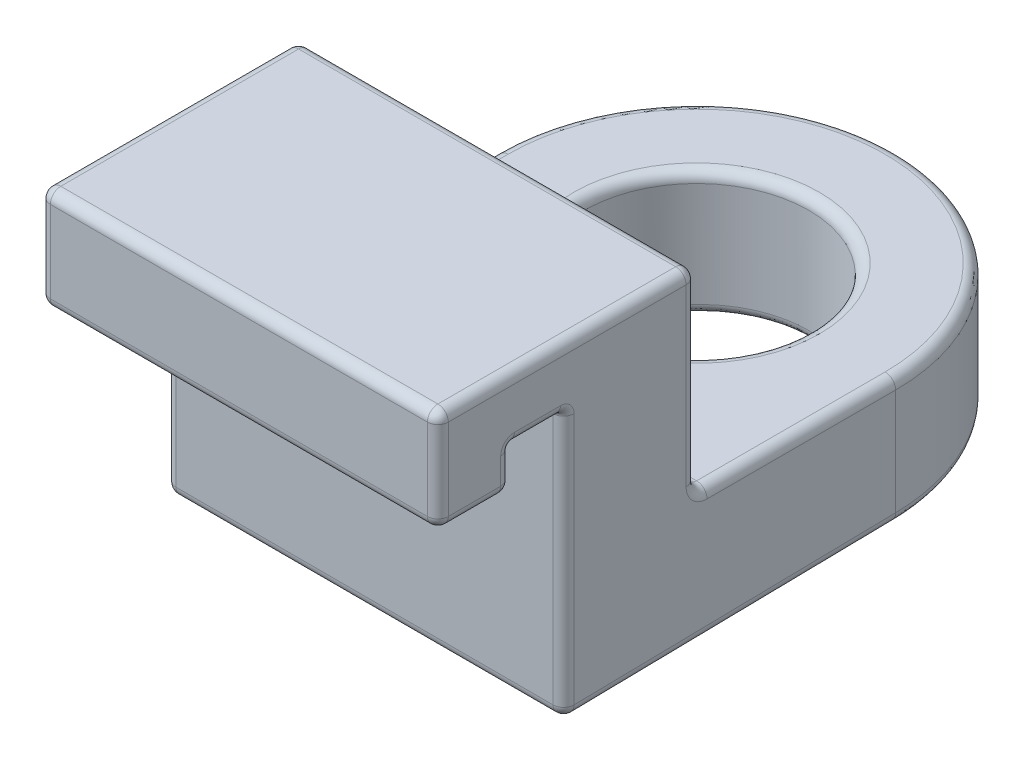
ISO-10303-21;
HEADER;
FILE_DESCRIPTION(('STEP AP214'),'2;1');
FILE_NAME('part.step','',(''),(''),'','','');
FILE_SCHEMA(('AUTOMOTIVE_DESIGN { 1 0 10303 214 1 1 1 1 }'));
ENDSEC;
DATA;
#1=APPLICATION_CONTEXT('core data for automotive mechanical design processes');
#2=APPLICATION_PROTOCOL_DEFINITION('international standard','automotive_design',2000,#1);
#3=PRODUCT_CONTEXT('',#1,'mechanical');
#4=PRODUCT('Part','Part','',(#3));
#5=PRODUCT_RELATED_PRODUCT_CATEGORY('part','',(#4));
#6=PRODUCT_DEFINITION_FORMATION('','',#4);
#7=PRODUCT_DEFINITION_CONTEXT('part definition',#1,'design');
#8=PRODUCT_DEFINITION('design','',#6,#7);
#9=PRODUCT_DEFINITION_SHAPE('','',#8);
#10=(LENGTH_UNIT() NAMED_UNIT(*) SI_UNIT(.MILLI.,.METRE.));
#11=(NAMED_UNIT(*) PLANE_ANGLE_UNIT() SI_UNIT($,.RADIAN.));
#12=(NAMED_UNIT(*) SI_UNIT($,.STERADIAN.) SOLID_ANGLE_UNIT());
#13=UNCERTAINTY_MEASURE_WITH_UNIT(LENGTH_MEASURE(1.E-05),#10,'distance_accuracy_value','');
#14=(GEOMETRIC_REPRESENTATION_CONTEXT(3) GLOBAL_UNCERTAINTY_ASSIGNED_CONTEXT((#13)) GLOBAL_UNIT_ASSIGNED_CONTEXT((#10,
#11,#12)) REPRESENTATION_CONTEXT('',''));
#15=CARTESIAN_POINT('',(0.,0.,0.));
#16=DIRECTION('',(0.,0.,1.));
#17=DIRECTION('',(1.,0.,0.));
#18=AXIS2_PLACEMENT_3D('',#15,#16,#17);
#19=CARTESIAN_POINT('',(9.5,1.5,0.));
#20=DIRECTION('',(-1.,0.,0.));
#21=DIRECTION('',(0.,0.,1.));
#22=AXIS2_PLACEMENT_3D('',#19,#20,#21);
#23=PLANE('',#22);
#24=DIRECTION('',(0.,-1.,0.));
#25=VECTOR('',#24,1.);
#26=CARTESIAN_POINT('',(9.5,1.5,-0.5));
#27=LINE('',#26,#25);
#28=CARTESIAN_POINT('',(9.5,-1.65,-0.5));
#29=VERTEX_POINT('',#28);
#30=CARTESIAN_POINT('',(9.5,-13.6911963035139,-0.5));
#31=VERTEX_POINT('',#30);
#32=EDGE_CURVE('E312',#29,#31,#27,.T.);
#33=ORIENTED_EDGE('',*,*,#32,.T.);
#34=DIRECTION('',(0.,0.0174524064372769,-0.999847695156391));
#35=VECTOR('',#34,1.);
#36=CARTESIAN_POINT('',(9.5,-13.6952941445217,-0.265234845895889));
#37=LINE('',#36,#35);
#38=CARTESIAN_POINT('',(9.5,-13.4232610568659,-15.85));
#39=VERTEX_POINT('',#38);
#40=EDGE_CURVE('E314',#31,#39,#37,.T.);
#41=ORIENTED_EDGE('',*,*,#40,.T.);
#42=DIRECTION('',(0.,1.,0.));
#43=VECTOR('',#42,1.);
#44=CARTESIAN_POINT('',(9.5,-14.2,-15.85));
#45=LINE('',#44,#43);
#46=CARTESIAN_POINT('',(9.5,-8.35,-15.85));
#47=VERTEX_POINT('',#46);
#48=EDGE_CURVE('E242',#39,#47,#45,.T.);
#49=ORIENTED_EDGE('',*,*,#48,.T.);
#50=DIRECTION('',(0.,0.,1.));
#51=VECTOR('',#50,1.);
#52=CARTESIAN_POINT('',(9.5,-8.35,0.));
#53=LINE('',#52,#51);
#54=CARTESIAN_POINT('',(9.5,-8.35,-6.85));
#55=VERTEX_POINT('',#54);
#56=EDGE_CURVE('E304',#47,#55,#53,.T.);
#57=ORIENTED_EDGE('',*,*,#56,.T.);
#58=CARTESIAN_POINT('',(9.5,-7.35,-6.85));
#59=DIRECTION('',(-1.,0.,0.));
#60=DIRECTION('',(0.,0.,1.));
#61=AXIS2_PLACEMENT_3D('',#58,#59,#60);
#62=CIRCLE('',#61,1.);
#63=CARTESIAN_POINT('',(9.5,-7.35,-5.85));
#64=VERTEX_POINT('',#63);
#65=EDGE_CURVE('E301',#64,#55,#62,.F.);
#66=ORIENTED_EDGE('',*,*,#65,.F.);
#67=DIRECTION('',(0.,1.,0.));
#68=VECTOR('',#67,1.);
#69=CARTESIAN_POINT('',(9.5,1.5,-5.85));
#70=LINE('',#69,#68);
#71=CARTESIAN_POINT('',(9.5,1.,-5.85));
#72=VERTEX_POINT('',#71);
#73=EDGE_CURVE('E293',#64,#72,#70,.T.);
#74=ORIENTED_EDGE('',*,*,#73,.T.);
#75=DIRECTION('',(0.,0.,1.));
#76=VECTOR('',#75,1.);
#77=CARTESIAN_POINT('',(9.5,1.,0.));
#78=LINE('',#77,#76);
#79=CARTESIAN_POINT('',(9.5,1.,5.5));
#80=VERTEX_POINT('',#79);
#81=EDGE_CURVE('E291',#72,#80,#78,.T.);
#82=ORIENTED_EDGE('',*,*,#81,.T.);
#83=DIRECTION('',(0.,-1.,0.));
#84=VECTOR('',#83,1.);
#85=CARTESIAN_POINT('',(9.5,1.5,5.5));
#86=LINE('',#85,#84);
#87=CARTESIAN_POINT('',(9.5,-2.9,5.5));
#88=VERTEX_POINT('',#87);
#89=EDGE_CURVE('E295',#80,#88,#86,.T.);
#90=ORIENTED_EDGE('',*,*,#89,.T.);
#91=DIRECTION('',(0.,0.,-1.));
#92=VECTOR('',#91,1.);
#93=CARTESIAN_POINT('',(9.5,-2.9,0.));
#94=LINE('',#93,#92);
#95=CARTESIAN_POINT('',(9.5,-2.9,3.));
#96=VERTEX_POINT('',#95);
#97=EDGE_CURVE('E297',#88,#96,#94,.T.);
#98=ORIENTED_EDGE('',*,*,#97,.T.);
#99=DIRECTION('',(0.,1.,0.));
#100=VECTOR('',#99,1.);
#101=CARTESIAN_POINT('',(9.5,1.5,3.));
#102=LINE('',#101,#100);
#103=CARTESIAN_POINT('',(9.5,-1.65,3.));
#104=VERTEX_POINT('',#103);
#105=EDGE_CURVE('E299',#96,#104,#102,.T.);
#106=ORIENTED_EDGE('',*,*,#105,.T.);
#107=CARTESIAN_POINT('',(9.5,-1.65,2.35));
#108=DIRECTION('',(-1.,0.,0.));
#109=DIRECTION('',(0.,0.,1.));
#110=AXIS2_PLACEMENT_3D('',#107,#108,#109);
#111=CIRCLE('',#110,0.65);
#112=CARTESIAN_POINT('',(9.5,-1.,2.35));
#113=VERTEX_POINT('',#112);
#114=EDGE_CURVE('E306',#104,#113,#111,.T.);
#115=ORIENTED_EDGE('',*,*,#114,.T.);
#116=DIRECTION('',(0.,0.,-1.));
#117=VECTOR('',#116,1.);
#118=CARTESIAN_POINT('',(9.5,-1.,0.));
#119=LINE('',#118,#117);
#120=CARTESIAN_POINT('',(9.5,-1.,0.15));
#121=VERTEX_POINT('',#120);
#122=EDGE_CURVE('E308',#113,#121,#119,.T.);
#123=ORIENTED_EDGE('',*,*,#122,.T.);
#124=CARTESIAN_POINT('',(9.5,-1.65,0.15));
#125=DIRECTION('',(-1.,0.,0.));
#126=DIRECTION('',(0.,0.,1.));
#127=AXIS2_PLACEMENT_3D('',#124,#125,#126);
#128=CIRCLE('',#127,0.65);
#129=EDGE_CURVE('E310',#121,#29,#128,.T.);
#130=ORIENTED_EDGE('',*,*,#129,.T.);
#131=EDGE_LOOP('',(#33,#41,#49,#57,#66,#74,#82,#90,#98,#106,#115,#123,#130));
#132=FACE_BOUND('',#131,.T.);
#133=ADVANCED_FACE('F14',(#132),#23,.F.);
#134=CARTESIAN_POINT('',(-9.5,1.5,0.));
#135=DIRECTION('',(-1.,0.,0.));
#136=DIRECTION('',(0.,0.,1.));
#137=AXIS2_PLACEMENT_3D('',#134,#135,#136);
#138=PLANE('',#137);
#139=DIRECTION('',(0.,1.,0.));
#140=VECTOR('',#139,1.);
#141=CARTESIAN_POINT('',(-9.5,-14.2,-15.85));
#142=LINE('',#141,#140);
#143=CARTESIAN_POINT('',(-9.5,-8.35,-15.85));
#144=VERTEX_POINT('',#143);
#145=CARTESIAN_POINT('',(-9.5,-13.4232610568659,-15.85));
#146=VERTEX_POINT('',#145);
#147=EDGE_CURVE('E221',#144,#146,#142,.F.);
#148=ORIENTED_EDGE('',*,*,#147,.T.);
#149=DIRECTION('',(0.,0.0174524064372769,-0.999847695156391));
#150=VECTOR('',#149,1.);
#151=CARTESIAN_POINT('',(-9.5,-13.7000761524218,0.00872620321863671));
#152=LINE('',#151,#150);
#153=CARTESIAN_POINT('',(-9.5,-13.6911963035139,-0.5));
#154=VERTEX_POINT('',#153);
#155=EDGE_CURVE('E289',#146,#154,#152,.F.);
#156=ORIENTED_EDGE('',*,*,#155,.T.);
#157=DIRECTION('',(0.,-1.,0.));
#158=VECTOR('',#157,1.);
#159=CARTESIAN_POINT('',(-9.5,-1.65,-0.5));
#160=LINE('',#159,#158);
#161=CARTESIAN_POINT('',(-9.5,-1.65,-0.5));
#162=VERTEX_POINT('',#161);
#163=EDGE_CURVE('E287',#154,#162,#160,.F.);
#164=ORIENTED_EDGE('',*,*,#163,.T.);
#165=CARTESIAN_POINT('',(-9.5,-1.65,0.15));
#166=DIRECTION('',(-1.,0.,0.));
#167=DIRECTION('',(0.,0.,1.));
#168=AXIS2_PLACEMENT_3D('',#165,#166,#167);
#169=CIRCLE('',#168,0.65);
#170=CARTESIAN_POINT('',(-9.5,-1.,0.15));
#171=VERTEX_POINT('',#170);
#172=EDGE_CURVE('E285',#162,#171,#169,.F.);
#173=ORIENTED_EDGE('',*,*,#172,.T.);
#174=DIRECTION('',(0.,0.,-1.));
#175=VECTOR('',#174,1.);
#176=CARTESIAN_POINT('',(-9.5,-1.,2.35));
#177=LINE('',#176,#175);
#178=CARTESIAN_POINT('',(-9.5,-1.,2.35));
#179=VERTEX_POINT('',#178);
#180=EDGE_CURVE('E229',#171,#179,#177,.F.);
#181=ORIENTED_EDGE('',*,*,#180,.T.);
#182=CARTESIAN_POINT('',(-9.5,-1.65,2.35));
#183=DIRECTION('',(-1.,0.,0.));
#184=DIRECTION('',(0.,0.,1.));
#185=AXIS2_PLACEMENT_3D('',#182,#183,#184);
#186=CIRCLE('',#185,0.65);
#187=CARTESIAN_POINT('',(-9.5,-1.65,3.));
#188=VERTEX_POINT('',#187);
#189=EDGE_CURVE('E230',#179,#188,#186,.F.);
#190=ORIENTED_EDGE('',*,*,#189,.T.);
#191=DIRECTION('',(0.,1.,0.));
#192=VECTOR('',#191,1.);
#193=CARTESIAN_POINT('',(-9.5,-3.4,3.));
#194=LINE('',#193,#192);
#195=CARTESIAN_POINT('',(-9.5,-2.9,3.));
#196=VERTEX_POINT('',#195);
#197=EDGE_CURVE('E280',#188,#196,#194,.F.);
#198=ORIENTED_EDGE('',*,*,#197,.T.);
#199=DIRECTION('',(0.,0.,-1.));
#200=VECTOR('',#199,1.);
#201=CARTESIAN_POINT('',(-9.5,-2.9,6.));
#202=LINE('',#201,#200);
#203=CARTESIAN_POINT('',(-9.5,-2.9,5.5));
#204=VERTEX_POINT('',#203);
#205=EDGE_CURVE('E278',#196,#204,#202,.F.);
#206=ORIENTED_EDGE('',*,*,#205,.T.);
#207=DIRECTION('',(0.,-1.,0.));
#208=VECTOR('',#207,1.);
#209=CARTESIAN_POINT('',(-9.5,1.5,5.5));
#210=LINE('',#209,#208);
#211=CARTESIAN_POINT('',(-9.5,1.,5.5));
#212=VERTEX_POINT('',#211);
#213=EDGE_CURVE('E276',#204,#212,#210,.F.);
#214=ORIENTED_EDGE('',*,*,#213,.T.);
#215=DIRECTION('',(0.,0.,1.));
#216=VECTOR('',#215,1.);
#217=CARTESIAN_POINT('',(-9.5,1.,-6.35));
#218=LINE('',#217,#216);
#219=CARTESIAN_POINT('',(-9.5,1.,-5.85));
#220=VERTEX_POINT('',#219);
#221=EDGE_CURVE('E272',#212,#220,#218,.F.);
#222=ORIENTED_EDGE('',*,*,#221,.T.);
#223=DIRECTION('',(0.,1.,0.));
#224=VECTOR('',#223,1.);
#225=CARTESIAN_POINT('',(-9.5,-7.85,-5.85));
#226=LINE('',#225,#224);
#227=CARTESIAN_POINT('',(-9.5,-7.35,-5.85));
#228=VERTEX_POINT('',#227);
#229=EDGE_CURVE('E274',#220,#228,#226,.F.);
#230=ORIENTED_EDGE('',*,*,#229,.T.);
#231=CARTESIAN_POINT('',(-9.5,-7.35,-6.85));
#232=DIRECTION('',(-1.,0.,0.));
#233=DIRECTION('',(0.,0.,1.));
#234=AXIS2_PLACEMENT_3D('',#231,#232,#233);
#235=CIRCLE('',#234,1.);
#236=CARTESIAN_POINT('',(-9.5,-8.35,-6.85));
#237=VERTEX_POINT('',#236);
#238=EDGE_CURVE('E224',#237,#228,#235,.T.);
#239=ORIENTED_EDGE('',*,*,#238,.F.);
#240=DIRECTION('',(0.,0.,1.));
#241=VECTOR('',#240,1.);
#242=CARTESIAN_POINT('',(-9.5,-8.35,-15.85));
#243=LINE('',#242,#241);
#244=EDGE_CURVE('E218',#237,#144,#243,.F.);
#245=ORIENTED_EDGE('',*,*,#244,.T.);
#246=EDGE_LOOP('',(#148,#156,#164,#173,#181,#190,#198,#206,#214,#222,#230,#239,#245));
#247=FACE_BOUND('',#246,.T.);
#248=ADVANCED_FACE('F220',(#247),#138,.T.);
#249=CARTESIAN_POINT('',(9.5,1.5,6.));
#250=DIRECTION('',(0.,-1.,0.));
#251=DIRECTION('',(0.,0.,-1.));
#252=AXIS2_PLACEMENT_3D('',#249,#250,#251);
#253=PLANE('',#252);
#254=DIRECTION('',(0.,0.,1.));
#255=VECTOR('',#254,1.);
#256=CARTESIAN_POINT('',(-9.,1.5,6.));
#257=LINE('',#256,#255);
#258=CARTESIAN_POINT('',(-9.,1.5,-5.85));
#259=VERTEX_POINT('',#258);
#260=CARTESIAN_POINT('',(-9.,1.5,5.5));
#261=VERTEX_POINT('',#260);
#262=EDGE_CURVE('E22',#259,#261,#257,.T.);
#263=ORIENTED_EDGE('',*,*,#262,.T.);
#264=DIRECTION('',(-1.,0.,0.));
#265=VECTOR('',#264,1.);
#266=CARTESIAN_POINT('',(9.5,1.5,5.5));
#267=LINE('',#266,#265);
#268=CARTESIAN_POINT('',(9.,1.5,5.5));
#269=VERTEX_POINT('',#268);
#270=EDGE_CURVE('E9',#261,#269,#267,.F.);
#271=ORIENTED_EDGE('',*,*,#270,.T.);
#272=DIRECTION('',(0.,0.,1.));
#273=VECTOR('',#272,1.);
#274=CARTESIAN_POINT('',(9.,1.5,6.));
#275=LINE('',#274,#273);
#276=CARTESIAN_POINT('',(9.,1.5,-5.85));
#277=VERTEX_POINT('',#276);
#278=EDGE_CURVE('E388',#269,#277,#275,.F.);
#279=ORIENTED_EDGE('',*,*,#278,.T.);
#280=DIRECTION('',(-1.,0.,0.));
#281=VECTOR('',#280,1.);
#282=CARTESIAN_POINT('',(9.5,1.5,-5.85));
#283=LINE('',#282,#281);
#284=EDGE_CURVE('E386',#277,#259,#283,.T.);
#285=ORIENTED_EDGE('',*,*,#284,.T.);
#286=EDGE_LOOP('',(#263,#271,#279,#285));
#287=FACE_BOUND('',#286,.T.);
#288=ADVANCED_FACE('F16',(#287),#253,.F.);
#289=CARTESIAN_POINT('',(9.5,1.5,6.));
#290=DIRECTION('',(0.,0.,-1.));
#291=DIRECTION('',(-1.,0.,0.));
#292=AXIS2_PLACEMENT_3D('',#289,#290,#291);
#293=PLANE('',#292);
#294=DIRECTION('',(0.,-1.,0.));
#295=VECTOR('',#294,1.);
#296=CARTESIAN_POINT('',(9.,1.5,6.));
#297=LINE('',#296,#295);
#298=CARTESIAN_POINT('',(9.,-2.9,6.));
#299=VERTEX_POINT('',#298);
#300=CARTESIAN_POINT('',(9.,1.,6.));
#301=VERTEX_POINT('',#300);
#302=EDGE_CURVE('E370',#299,#301,#297,.F.);
#303=ORIENTED_EDGE('',*,*,#302,.T.);
#304=DIRECTION('',(-1.,0.,0.));
#305=VECTOR('',#304,1.);
#306=CARTESIAN_POINT('',(9.5,1.,6.));
#307=LINE('',#306,#305);
#308=CARTESIAN_POINT('',(-9.,1.,6.));
#309=VERTEX_POINT('',#308);
#310=EDGE_CURVE('E375',#301,#309,#307,.T.);
#311=ORIENTED_EDGE('',*,*,#310,.T.);
#312=DIRECTION('',(0.,-1.,0.));
#313=VECTOR('',#312,1.);
#314=CARTESIAN_POINT('',(-9.,-3.4,6.));
#315=LINE('',#314,#313);
#316=CARTESIAN_POINT('',(-9.,-2.9,6.));
#317=VERTEX_POINT('',#316);
#318=EDGE_CURVE('E372',#309,#317,#315,.T.);
#319=ORIENTED_EDGE('',*,*,#318,.T.);
#320=DIRECTION('',(-1.,0.,0.));
#321=VECTOR('',#320,1.);
#322=CARTESIAN_POINT('',(9.5,-2.9,6.));
#323=LINE('',#322,#321);
#324=EDGE_CURVE('E368',#317,#299,#323,.F.);
#325=ORIENTED_EDGE('',*,*,#324,.T.);
#326=EDGE_LOOP('',(#303,#311,#319,#325));
#327=FACE_BOUND('',#326,.T.);
#328=ADVANCED_FACE('F733',(#327),#293,.F.);
#329=CARTESIAN_POINT('',(9.5,-3.4,6.));
#330=DIRECTION('',(0.,1.,0.));
#331=DIRECTION('',(0.,0.,1.));
#332=AXIS2_PLACEMENT_3D('',#329,#330,#331);
#333=PLANE('',#332);
#334=DIRECTION('',(0.,0.,-1.));
#335=VECTOR('',#334,1.);
#336=CARTESIAN_POINT('',(-9.,-3.4,2.5));
#337=LINE('',#336,#335);
#338=CARTESIAN_POINT('',(-9.,-3.4,5.5));
#339=VERTEX_POINT('',#338);
#340=CARTESIAN_POINT('',(-9.,-3.4,3.));
#341=VERTEX_POINT('',#340);
#342=EDGE_CURVE('E357',#339,#341,#337,.T.);
#343=ORIENTED_EDGE('',*,*,#342,.T.);
#344=DIRECTION('',(-1.,0.,0.));
#345=VECTOR('',#344,1.);
#346=CARTESIAN_POINT('',(9.5,-3.4,3.));
#347=LINE('',#346,#345);
#348=CARTESIAN_POINT('',(9.,-3.4,3.));
#349=VERTEX_POINT('',#348);
#350=EDGE_CURVE('E362',#341,#349,#347,.F.);
#351=ORIENTED_EDGE('',*,*,#350,.T.);
#352=DIRECTION('',(0.,0.,-1.));
#353=VECTOR('',#352,1.);
#354=CARTESIAN_POINT('',(9.,-3.4,6.));
#355=LINE('',#354,#353);
#356=CARTESIAN_POINT('',(9.,-3.4,5.5));
#357=VERTEX_POINT('',#356);
#358=EDGE_CURVE('E359',#349,#357,#355,.F.);
#359=ORIENTED_EDGE('',*,*,#358,.T.);
#360=DIRECTION('',(-1.,0.,0.));
#361=VECTOR('',#360,1.);
#362=CARTESIAN_POINT('',(9.5,-3.4,5.5));
#363=LINE('',#362,#361);
#364=EDGE_CURVE('E355',#357,#339,#363,.T.);
#365=ORIENTED_EDGE('',*,*,#364,.T.);
#366=EDGE_LOOP('',(#343,#351,#359,#365));
#367=FACE_BOUND('',#366,.T.);
#368=ADVANCED_FACE('F643',(#367),#333,.F.);
#369=CARTESIAN_POINT('',(9.5,-3.4,2.5));
#370=DIRECTION('',(0.,0.,1.));
#371=DIRECTION('',(1.,0.,0.));
#372=AXIS2_PLACEMENT_3D('',#369,#370,#371);
#373=PLANE('',#372);
#374=DIRECTION('',(-1.,0.,0.));
#375=VECTOR('',#374,1.);
#376=CARTESIAN_POINT('',(9.5,-2.9,2.5));
#377=LINE('',#376,#375);
#378=CARTESIAN_POINT('',(9.,-2.9,2.5));
#379=VERTEX_POINT('',#378);
#380=CARTESIAN_POINT('',(-9.,-2.9,2.5));
#381=VERTEX_POINT('',#380);
#382=EDGE_CURVE('E316',#379,#381,#377,.T.);
#383=ORIENTED_EDGE('',*,*,#382,.T.);
#384=DIRECTION('',(0.,1.,0.));
#385=VECTOR('',#384,1.);
#386=CARTESIAN_POINT('',(-9.,-1.65,2.5));
#387=LINE('',#386,#385);
#388=CARTESIAN_POINT('',(-9.,-1.65,2.5));
#389=VERTEX_POINT('',#388);
#390=EDGE_CURVE('E320',#381,#389,#387,.T.);
#391=ORIENTED_EDGE('',*,*,#390,.T.);
#392=DIRECTION('',(-1.,0.,0.));
#393=VECTOR('',#392,1.);
#394=CARTESIAN_POINT('',(9.5,-1.65,2.5));
#395=LINE('',#394,#393);
#396=CARTESIAN_POINT('',(9.,-1.65,2.5));
#397=VERTEX_POINT('',#396);
#398=EDGE_CURVE('E261',#389,#397,#395,.F.);
#399=ORIENTED_EDGE('',*,*,#398,.T.);
#400=DIRECTION('',(0.,1.,0.));
#401=VECTOR('',#400,1.);
#402=CARTESIAN_POINT('',(9.,-3.4,2.5));
#403=LINE('',#402,#401);
#404=EDGE_CURVE('E318',#397,#379,#403,.F.);
#405=ORIENTED_EDGE('',*,*,#404,.T.);
#406=EDGE_LOOP('',(#383,#391,#399,#405));
#407=FACE_BOUND('',#406,.T.);
#408=ADVANCED_FACE('F739',(#407),#373,.F.);
#409=CARTESIAN_POINT('',(9.5,-1.5,2.5));
#410=DIRECTION('',(0.,1.,0.));
#411=DIRECTION('',(0.,0.,1.));
#412=AXIS2_PLACEMENT_3D('',#409,#410,#411);
#413=PLANE('',#412);
#414=DIRECTION('',(-1.,0.,0.));
#415=VECTOR('',#414,1.);
#416=CARTESIAN_POINT('',(-9.5,-1.5,2.35));
#417=LINE('',#416,#415);
#418=CARTESIAN_POINT('',(9.,-1.5,2.35));
#419=VERTEX_POINT('',#418);
#420=CARTESIAN_POINT('',(-9.,-1.5,2.35));
#421=VERTEX_POINT('',#420);
#422=EDGE_CURVE('E755',#419,#421,#417,.T.);
#423=ORIENTED_EDGE('',*,*,#422,.T.);
#424=DIRECTION('',(0.,0.,-1.));
#425=VECTOR('',#424,1.);
#426=CARTESIAN_POINT('',(-9.,-1.5,0.15));
#427=LINE('',#426,#425);
#428=CARTESIAN_POINT('',(-9.,-1.5,0.15));
#429=VERTEX_POINT('',#428);
#430=EDGE_CURVE('E366',#421,#429,#427,.T.);
#431=ORIENTED_EDGE('',*,*,#430,.T.);
#432=DIRECTION('',(-1.,0.,0.));
#433=VECTOR('',#432,1.);
#434=CARTESIAN_POINT('',(9.5,-1.5,0.15));
#435=LINE('',#434,#433);
#436=CARTESIAN_POINT('',(9.,-1.5,0.15));
#437=VERTEX_POINT('',#436);
#438=EDGE_CURVE('E758',#429,#437,#435,.F.);
#439=ORIENTED_EDGE('',*,*,#438,.T.);
#440=DIRECTION('',(0.,0.,-1.));
#441=VECTOR('',#440,1.);
#442=CARTESIAN_POINT('',(9.,-1.5,2.5));
#443=LINE('',#442,#441);
#444=EDGE_CURVE('E364',#437,#419,#443,.F.);
#445=ORIENTED_EDGE('',*,*,#444,.T.);
#446=EDGE_LOOP('',(#423,#431,#439,#445));
#447=FACE_BOUND('',#446,.T.);
#448=ADVANCED_FACE('F744',(#447),#413,.F.);
#449=CARTESIAN_POINT('',(9.5,-1.5,0.));
#450=DIRECTION('',(0.,0.,-1.));
#451=DIRECTION('',(0.,1.,0.));
#452=AXIS2_PLACEMENT_3D('',#449,#450,#451);
#453=PLANE('',#452);
#454=DIRECTION('',(-1.,0.,0.));
#455=VECTOR('',#454,1.);
#456=CARTESIAN_POINT('',(-9.5,-1.65,0.));
#457=LINE('',#456,#455);
#458=CARTESIAN_POINT('',(9.,-1.65,0.));
#459=VERTEX_POINT('',#458);
#460=CARTESIAN_POINT('',(-9.,-1.65,0.));
#461=VERTEX_POINT('',#460);
#462=EDGE_CURVE('E241',#459,#461,#457,.T.);
#463=ORIENTED_EDGE('',*,*,#462,.T.);
#464=DIRECTION('',(0.,-1.,0.));
#465=VECTOR('',#464,1.);
#466=CARTESIAN_POINT('',(-9.,-14.2,0.));
#467=LINE('',#466,#465);
#468=CARTESIAN_POINT('',(-9.,-13.6911963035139,0.));
#469=VERTEX_POINT('',#468);
#470=EDGE_CURVE('E331',#461,#469,#467,.T.);
#471=ORIENTED_EDGE('',*,*,#470,.T.);
#472=DIRECTION('',(-1.,0.,0.));
#473=VECTOR('',#472,1.);
#474=CARTESIAN_POINT('',(9.5,-13.6911963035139,0.));
#475=LINE('',#474,#473);
#476=CARTESIAN_POINT('',(9.,-13.6911963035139,0.));
#477=VERTEX_POINT('',#476);
#478=EDGE_CURVE('E327',#469,#477,#475,.F.);
#479=ORIENTED_EDGE('',*,*,#478,.T.);
#480=DIRECTION('',(0.,-1.,0.));
#481=VECTOR('',#480,1.);
#482=CARTESIAN_POINT('',(9.,-1.5,0.));
#483=LINE('',#482,#481);
#484=EDGE_CURVE('E329',#477,#459,#483,.F.);
#485=ORIENTED_EDGE('',*,*,#484,.T.);
#486=EDGE_LOOP('',(#463,#471,#479,#485));
#487=FACE_BOUND('',#486,.T.);
#488=ADVANCED_FACE('F550',(#487),#453,.F.);
#489=CARTESIAN_POINT('',(9.5,-14.2,0.));
#490=DIRECTION('',(0.,0.999847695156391,0.0174524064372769));
#491=DIRECTION('',(0.,-0.0174524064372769,0.999847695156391));
#492=AXIS2_PLACEMENT_3D('',#489,#490,#491);
#493=PLANE('',#492);
#494=CARTESIAN_POINT('',(0.,-13.9231849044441,-15.8587262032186));
#495=DIRECTION('',(0.,0.999847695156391,0.0174524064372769));
#496=DIRECTION('',(0.,0.0174524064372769,-0.999847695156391));
#497=AXIS2_PLACEMENT_3D('',#494,#495,#496);
#498=ELLIPSE('',#497,5.8608926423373,5.86);
#499=CARTESIAN_POINT('',(0.,-13.8208982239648,-21.7187262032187));
#500=VERTEX_POINT('',#499);
#501=EDGE_CURVE('E346',#500,#500,#498,.T.);
#502=ORIENTED_EDGE('',*,*,#501,.T.);
#503=EDGE_LOOP('',(#502));
#504=FACE_BOUND('',#503,.T.);
#505=DIRECTION('',(0.,0.0174524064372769,-0.999847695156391));
#506=VECTOR('',#505,1.);
#507=CARTESIAN_POINT('',(-9.,-13.9233372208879,-15.85));
#508=LINE('',#507,#506);
#509=CARTESIAN_POINT('',(-9.,-14.1911201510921,-0.50872620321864));
#510=VERTEX_POINT('',#509);
#511=CARTESIAN_POINT('',(-9.,-13.9231849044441,-15.8587262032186));
#512=VERTEX_POINT('',#511);
#513=EDGE_CURVE('E341',#510,#512,#508,.T.);
#514=ORIENTED_EDGE('',*,*,#513,.T.);
#515=CARTESIAN_POINT('',(0.,-13.9231849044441,-15.8587262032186));
#516=DIRECTION('',(0.,0.999847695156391,0.0174524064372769));
#517=DIRECTION('',(0.,0.0174524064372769,-0.999847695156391));
#518=AXIS2_PLACEMENT_3D('',#515,#516,#517);
#519=ELLIPSE('',#518,9.00137095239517,9.);
#520=CARTESIAN_POINT('',(9.,-13.9231849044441,-15.8587262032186));
#521=VERTEX_POINT('',#520);
#522=EDGE_CURVE('E343',#512,#521,#519,.F.);
#523=ORIENTED_EDGE('',*,*,#522,.T.);
#524=DIRECTION('',(0.,0.0174524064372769,-0.999847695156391));
#525=VECTOR('',#524,1.);
#526=CARTESIAN_POINT('',(9.,-14.2,0.));
#527=LINE('',#526,#525);
#528=CARTESIAN_POINT('',(9.,-14.1911201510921,-0.50872620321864));
#529=VERTEX_POINT('',#528);
#530=EDGE_CURVE('E339',#521,#529,#527,.F.);
#531=ORIENTED_EDGE('',*,*,#530,.T.);
#532=DIRECTION('',(-1.,0.,0.));
#533=VECTOR('',#532,1.);
#534=CARTESIAN_POINT('',(9.5,-14.1911201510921,-0.50872620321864));
#535=LINE('',#534,#533);
#536=EDGE_CURVE('E337',#529,#510,#535,.T.);
#537=ORIENTED_EDGE('',*,*,#536,.T.);
#538=EDGE_LOOP('',(#514,#523,#531,#537));
#539=FACE_BOUND('',#538,.T.);
#540=ADVANCED_FACE('F525',(#504,#539),#493,.F.);
#541=CARTESIAN_POINT('',(9.5,-7.85,-25.35));
#542=DIRECTION('',(0.,-1.,0.));
#543=DIRECTION('',(0.,0.,-1.));
#544=AXIS2_PLACEMENT_3D('',#541,#542,#543);
#545=PLANE('',#544);
#546=CARTESIAN_POINT('',(0.,-7.85,-15.85));
#547=DIRECTION('',(0.,-1.,0.));
#548=DIRECTION('',(0.,0.,-1.));
#549=AXIS2_PLACEMENT_3D('',#546,#547,#548);
#550=CIRCLE('',#549,5.86);
#551=CARTESIAN_POINT('',(0.,-7.85,-21.71));
#552=VERTEX_POINT('',#551);
#553=EDGE_CURVE('E269',#552,#552,#550,.T.);
#554=ORIENTED_EDGE('',*,*,#553,.T.);
#555=EDGE_LOOP('',(#554));
#556=FACE_BOUND('',#555,.T.);
#557=DIRECTION('',(0.,0.,1.));
#558=VECTOR('',#557,1.);
#559=CARTESIAN_POINT('',(9.,-7.85,-25.35));
#560=LINE('',#559,#558);
#561=CARTESIAN_POINT('',(9.,-7.85,-6.85));
#562=VERTEX_POINT('',#561);
#563=CARTESIAN_POINT('',(9.,-7.85,-15.85));
#564=VERTEX_POINT('',#563);
#565=EDGE_CURVE('E259',#562,#564,#560,.F.);
#566=ORIENTED_EDGE('',*,*,#565,.T.);
#567=CARTESIAN_POINT('',(0.,-7.85,-15.85));
#568=DIRECTION('',(0.,-1.,0.));
#569=DIRECTION('',(0.,0.,-1.));
#570=AXIS2_PLACEMENT_3D('',#567,#568,#569);
#571=CIRCLE('',#570,9.);
#572=CARTESIAN_POINT('',(-9.,-7.85,-15.85));
#573=VERTEX_POINT('',#572);
#574=EDGE_CURVE('E267',#564,#573,#571,.F.);
#575=ORIENTED_EDGE('',*,*,#574,.T.);
#576=DIRECTION('',(0.,0.,1.));
#577=VECTOR('',#576,1.);
#578=CARTESIAN_POINT('',(-9.,-7.85,-6.35));
#579=LINE('',#578,#577);
#580=CARTESIAN_POINT('',(-9.,-7.85,-6.85));
#581=VERTEX_POINT('',#580);
#582=EDGE_CURVE('E247',#573,#581,#579,.T.);
#583=ORIENTED_EDGE('',*,*,#582,.T.);
#584=DIRECTION('',(-1.,0.,0.));
#585=VECTOR('',#584,1.);
#586=CARTESIAN_POINT('',(9.5,-7.85,-6.85));
#587=LINE('',#586,#585);
#588=EDGE_CURVE('E257',#581,#562,#587,.F.);
#589=ORIENTED_EDGE('',*,*,#588,.T.);
#590=EDGE_LOOP('',(#566,#575,#583,#589));
#591=FACE_BOUND('',#590,.T.);
#592=ADVANCED_FACE('F542',(#556,#591),#545,.F.);
#593=CARTESIAN_POINT('',(9.5,-7.85,-6.35));
#594=DIRECTION('',(0.,0.,1.));
#595=DIRECTION('',(0.,-1.,0.));
#596=AXIS2_PLACEMENT_3D('',#593,#594,#595);
#597=PLANE('',#596);
#598=DIRECTION('',(0.,1.,0.));
#599=VECTOR('',#598,1.);
#600=CARTESIAN_POINT('',(-9.,1.5,-6.35));
#601=LINE('',#600,#599);
#602=CARTESIAN_POINT('',(-9.,-7.35,-6.35));
#603=VERTEX_POINT('',#602);
#604=CARTESIAN_POINT('',(-9.,1.,-6.35));
#605=VERTEX_POINT('',#604);
#606=EDGE_CURVE('E381',#603,#605,#601,.T.);
#607=ORIENTED_EDGE('',*,*,#606,.T.);
#608=DIRECTION('',(-1.,0.,0.));
#609=VECTOR('',#608,1.);
#610=CARTESIAN_POINT('',(9.5,1.,-6.35));
#611=LINE('',#610,#609);
#612=CARTESIAN_POINT('',(9.,1.,-6.35));
#613=VERTEX_POINT('',#612);
#614=EDGE_CURVE('E384',#605,#613,#611,.F.);
#615=ORIENTED_EDGE('',*,*,#614,.T.);
#616=DIRECTION('',(0.,1.,0.));
#617=VECTOR('',#616,1.);
#618=CARTESIAN_POINT('',(9.,-7.85,-6.35));
#619=LINE('',#618,#617);
#620=CARTESIAN_POINT('',(9.,-7.35,-6.35));
#621=VERTEX_POINT('',#620);
#622=EDGE_CURVE('E379',#613,#621,#619,.F.);
#623=ORIENTED_EDGE('',*,*,#622,.T.);
#624=DIRECTION('',(-1.,0.,0.));
#625=VECTOR('',#624,1.);
#626=CARTESIAN_POINT('',(-9.5,-7.35,-6.35));
#627=LINE('',#626,#625);
#628=EDGE_CURVE('E377',#621,#603,#627,.T.);
#629=ORIENTED_EDGE('',*,*,#628,.T.);
#630=EDGE_LOOP('',(#607,#615,#623,#629));
#631=FACE_BOUND('',#630,.T.);
#632=ADVANCED_FACE('F534',(#631),#597,.F.);
#633=CARTESIAN_POINT('',(0.,-14.2,-15.85));
#634=DIRECTION('',(0.,1.,0.));
#635=DIRECTION('',(0.,0.,1.));
#636=AXIS2_PLACEMENT_3D('',#633,#634,#635);
#637=CYLINDRICAL_SURFACE('',#636,9.5);
#638=ORIENTED_EDGE('',*,*,#147,.F.);
#639=CARTESIAN_POINT('',(0.,-8.35,-15.85));
#640=DIRECTION('',(0.,-1.,0.));
#641=DIRECTION('',(0.,0.,-1.));
#642=AXIS2_PLACEMENT_3D('',#639,#640,#641);
#643=CIRCLE('',#642,9.5);
#644=EDGE_CURVE('E237',#144,#47,#643,.T.);
#645=ORIENTED_EDGE('',*,*,#644,.T.);
#646=ORIENTED_EDGE('',*,*,#48,.F.);
#647=CARTESIAN_POINT('',(0.,-13.4232610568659,-15.85));
#648=DIRECTION('',(0.,-0.999863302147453,-0.0165341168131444));
#649=DIRECTION('',(0.,0.0165341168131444,-0.999863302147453));
#650=AXIS2_PLACEMENT_3D('',#647,#648,#649);
#651=ELLIPSE('',#650,9.50129880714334,9.5);
#652=EDGE_CURVE('E240',#39,#146,#651,.F.);
#653=ORIENTED_EDGE('',*,*,#652,.T.);
#654=EDGE_LOOP('',(#638,#645,#646,#653));
#655=FACE_BOUND('',#654,.T.);
#656=ADVANCED_FACE('F234',(#655),#637,.T.);
#657=CARTESIAN_POINT('',(0.,-14.2,-15.85));
#658=DIRECTION('',(0.,1.,0.));
#659=DIRECTION('',(0.,0.,1.));
#660=AXIS2_PLACEMENT_3D('',#657,#658,#659);
#661=CYLINDRICAL_SURFACE('',#660,5.36);
#662=CARTESIAN_POINT('',(0.,-13.4232610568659,-15.85));
#663=DIRECTION('',(0.,-0.999817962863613,-0.0190798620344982));
#664=DIRECTION('',(0.,0.0190798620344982,-0.999817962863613));
#665=AXIS2_PLACEMENT_3D('',#662,#663,#664);
#666=ELLIPSE('',#665,5.36097589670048,5.36);
#667=CARTESIAN_POINT('',(0.,-13.3209743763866,-21.21));
#668=VERTEX_POINT('',#667);
#669=EDGE_CURVE('E352',#668,#668,#666,.T.);
#670=ORIENTED_EDGE('',*,*,#669,.T.);
#671=EDGE_LOOP('',(#670));
#672=FACE_BOUND('',#671,.T.);
#673=CARTESIAN_POINT('',(0.,-8.35,-15.85));
#674=DIRECTION('',(0.,-1.,0.));
#675=DIRECTION('',(0.,0.,-1.));
#676=AXIS2_PLACEMENT_3D('',#673,#674,#675);
#677=CIRCLE('',#676,5.36);
#678=CARTESIAN_POINT('',(0.,-8.35,-21.21));
#679=VERTEX_POINT('',#678);
#680=EDGE_CURVE('E349',#679,#679,#677,.F.);
#681=ORIENTED_EDGE('',*,*,#680,.T.);
#682=EDGE_LOOP('',(#681));
#683=FACE_BOUND('',#682,.T.);
#684=ADVANCED_FACE('F533',(#672,#683),#661,.F.);
#685=CARTESIAN_POINT('',(9.5,-1.65,0.15));
#686=DIRECTION('',(1.,0.,0.));
#687=DIRECTION('',(0.,0.,-1.));
#688=AXIS2_PLACEMENT_3D('',#685,#686,#687);
#689=CYLINDRICAL_SURFACE('',#688,0.15);
#690=ORIENTED_EDGE('',*,*,#438,.F.);
#691=CARTESIAN_POINT('',(-9.,-1.65,0.15));
#692=DIRECTION('',(-1.,0.,0.));
#693=DIRECTION('',(0.,0.,1.));
#694=AXIS2_PLACEMENT_3D('',#691,#692,#693);
#695=CIRCLE('',#694,0.15);
#696=EDGE_CURVE('E335',#429,#461,#695,.T.);
#697=ORIENTED_EDGE('',*,*,#696,.T.);
#698=ORIENTED_EDGE('',*,*,#462,.F.);
#699=CARTESIAN_POINT('',(9.,-1.65,0.15));
#700=DIRECTION('',(-1.,0.,0.));
#701=DIRECTION('',(0.,0.,1.));
#702=AXIS2_PLACEMENT_3D('',#699,#700,#701);
#703=CIRCLE('',#702,0.15);
#704=EDGE_CURVE('E333',#459,#437,#703,.F.);
#705=ORIENTED_EDGE('',*,*,#704,.T.);
#706=EDGE_LOOP('',(#690,#697,#698,#705));
#707=FACE_BOUND('',#706,.T.);
#708=ADVANCED_FACE('F767',(#707),#689,.F.);
#709=CARTESIAN_POINT('',(9.5,-1.65,2.35));
#710=DIRECTION('',(1.,0.,0.));
#711=DIRECTION('',(0.,0.,-1.));
#712=AXIS2_PLACEMENT_3D('',#709,#710,#711);
#713=CYLINDRICAL_SURFACE('',#712,0.15);
#714=ORIENTED_EDGE('',*,*,#398,.F.);
#715=CARTESIAN_POINT('',(-9.,-1.65,2.35));
#716=DIRECTION('',(-1.,0.,0.));
#717=DIRECTION('',(0.,0.,1.));
#718=AXIS2_PLACEMENT_3D('',#715,#716,#717);
#719=CIRCLE('',#718,0.15);
#720=EDGE_CURVE('E325',#389,#421,#719,.T.);
#721=ORIENTED_EDGE('',*,*,#720,.T.);
#722=ORIENTED_EDGE('',*,*,#422,.F.);
#723=CARTESIAN_POINT('',(9.,-1.65,2.35));
#724=DIRECTION('',(-1.,0.,0.));
#725=DIRECTION('',(0.,0.,1.));
#726=AXIS2_PLACEMENT_3D('',#723,#724,#725);
#727=CIRCLE('',#726,0.15);
#728=EDGE_CURVE('E323',#419,#397,#727,.F.);
#729=ORIENTED_EDGE('',*,*,#728,.T.);
#730=EDGE_LOOP('',(#714,#721,#722,#729));
#731=FACE_BOUND('',#730,.T.);
#732=ADVANCED_FACE('F521',(#731),#713,.F.);
#733=CARTESIAN_POINT('',(0.,-13.7660893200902,-24.8587262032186));
#734=CARTESIAN_POINT('',(0.,-13.7575141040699,-25.35));
#735=CARTESIAN_POINT('',(0.,-13.266165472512,-25.35));
#736=CARTESIAN_POINT('',(-0.392698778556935,-13.7660893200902,-24.8587262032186));
#737=CARTESIAN_POINT('',(-0.41414107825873,-13.7575141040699,-25.35));
#738=CARTESIAN_POINT('',(-0.414515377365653,-13.266165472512,-25.35));
#739=CARTESIAN_POINT('',(-0.78539755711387,-13.7665385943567,-24.8329872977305));
#740=CARTESIAN_POINT('',(-0.828302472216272,-13.757987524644,-25.3228777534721));
#741=CARTESIAN_POINT('',(-0.829030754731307,-13.2666147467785,-25.322831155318));
#742=CARTESIAN_POINT('',(-1.5640759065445,-13.7683279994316,-24.7304723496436));
#743=CARTESIAN_POINT('',(-1.64951731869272,-13.7598729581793,-25.2148613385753));
#744=CARTESIAN_POINT('',(-1.65096901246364,-13.2684041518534,-25.2146209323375));
#745=CARTESIAN_POINT('',(-1.95005544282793,-13.7696681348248,-24.6536960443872));
#746=CARTESIAN_POINT('',(-2.05660999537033,-13.7612851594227,-25.1339563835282));
#747=CARTESIAN_POINT('',(-2.05839185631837,-13.2697442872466,-25.133579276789));
#748=CARTESIAN_POINT('',(-2.7086911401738,-13.7732163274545,-24.450420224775));
#749=CARTESIAN_POINT('',(-2.85674261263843,-13.7650239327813,-24.9197622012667));
#750=CARTESIAN_POINT('',(-2.85917398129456,-13.2732924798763,-24.9190103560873));
#751=CARTESIAN_POINT('',(-3.08134716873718,-13.7754243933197,-24.3239202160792));
#752=CARTESIAN_POINT('',(-3.24981765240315,-13.7673508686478,-24.7864521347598));
#753=CARTESIAN_POINT('',(-3.25253312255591,-13.2755005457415,-24.7854825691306));
#754=CARTESIAN_POINT('',(-3.80695971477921,-13.780670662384,-24.0233616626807));
#755=CARTESIAN_POINT('',(-4.01521025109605,-13.7728793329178,-24.4697266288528));
#756=CARTESIAN_POINT('',(-4.01845747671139,-13.2807468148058,-24.4682263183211));
#757=CARTESIAN_POINT('',(-4.15991595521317,-13.7837088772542,-23.84930244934));
#758=CARTESIAN_POINT('',(-4.38755634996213,-13.7760813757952,-24.2862817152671));
#759=CARTESIAN_POINT('',(-4.39102239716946,-13.283785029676,-24.2844971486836));
#760=CARTESIAN_POINT('',(-4.84008990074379,-13.7905634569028,-23.4566038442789));
#761=CARTESIAN_POINT('',(-5.10513981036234,-13.7833053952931,-23.8724179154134));
#762=CARTESIAN_POINT('',(-5.10898378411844,-13.2906396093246,-23.8699819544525));
#763=CARTESIAN_POINT('',(-5.16730716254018,-13.7943798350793,-23.2379636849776));
#764=CARTESIAN_POINT('',(-5.45039716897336,-13.7873280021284,-23.6419629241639));
#765=CARTESIAN_POINT('',(-5.4543797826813,-13.2944559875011,-23.6391951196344));
#766=CARTESIAN_POINT('',(-5.79040454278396,-13.8027254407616,-22.7598442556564));
#767=CARTESIAN_POINT('',(-6.10791286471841,-13.79612453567,-23.1380098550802));
#768=CARTESIAN_POINT('',(-6.11209368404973,-13.3028015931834,-23.1345134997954));
#769=CARTESIAN_POINT('',(-6.08628405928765,-13.807254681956,-22.5003642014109));
#770=CARTESIAN_POINT('',(-6.42018125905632,-13.8008991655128,-22.8644714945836));
#771=CARTESIAN_POINT('',(-6.4244109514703,-13.3073308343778,-22.8606178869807));
#772=CARTESIAN_POINT('',(-6.64164352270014,-13.816948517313,-21.9450047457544));
#773=CARTESIAN_POINT('',(-7.00638948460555,-13.8111183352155,-22.2790156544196));
#774=CARTESIAN_POINT('',(-7.0106237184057,-13.3170246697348,-22.2744051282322));
#775=CARTESIAN_POINT('',(-6.90112274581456,-13.8221131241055,-21.6491246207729));
#776=CARTESIAN_POINT('',(-7.28032871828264,-13.8165636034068,-21.9670564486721));
#777=CARTESIAN_POINT('',(-7.28451845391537,-13.3221892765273,-21.9620872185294));
#778=CARTESIAN_POINT('',(-7.37924197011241,-13.8329893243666,-21.0260275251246));
#779=CARTESIAN_POINT('',(-7.78520024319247,-13.8280312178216,-21.3100772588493));
#780=CARTESIAN_POINT('',(-7.78919985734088,-13.3330654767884,-21.3043736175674));
#781=CARTESIAN_POINT('',(-7.5978811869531,-13.8387009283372,-20.6988099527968));
#782=CARTESIAN_POINT('',(-8.01612129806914,-13.8340542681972,-20.9650169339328));
#783=CARTESIAN_POINT('',(-8.01998569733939,-13.338777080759,-20.9589772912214));
#784=CARTESIAN_POINT('',(-7.99057946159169,-13.8505733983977,-20.0186365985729));
#785=CARTESIAN_POINT('',(-8.43100882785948,-13.8465747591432,-20.247718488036));
#786=CARTESIAN_POINT('',(-8.43450054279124,-13.3506495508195,-20.2410165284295));
#787=CARTESIAN_POINT('',(-8.16463775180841,-13.8567342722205,-19.6656803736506));
#788=CARTESIAN_POINT('',(-8.614954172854,-13.8530728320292,-19.8754441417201));
#789=CARTESIAN_POINT('',(-8.61822873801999,-13.3568104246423,-19.8684516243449));
#790=CARTESIAN_POINT('',(-8.4651959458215,-13.869399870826,-18.940068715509));
#791=CARTESIAN_POINT('',(-8.9327408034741,-13.8664325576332,-19.1100659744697));
#792=CARTESIAN_POINT('',(-8.93548460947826,-13.3694760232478,-19.1025282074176));
#793=CARTESIAN_POINT('',(-8.59169518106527,-13.8759046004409,-18.5674130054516));
#794=CARTESIAN_POINT('',(-9.0665524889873,-13.873294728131,-18.7169324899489));
#795=CARTESIAN_POINT('',(-9.06901158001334,-13.3759807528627,-18.709169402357));
#796=CARTESIAN_POINT('',(-8.79497070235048,-13.8891466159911,-17.8087784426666));
#797=CARTESIAN_POINT('',(-9.28177459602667,-13.8872655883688,-17.9165424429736));
#798=CARTESIAN_POINT('',(-9.28358018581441,-13.3892227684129,-17.9083884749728));
#799=CARTESIAN_POINT('',(-8.87174649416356,-13.8958839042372,-17.4227994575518));
#800=CARTESIAN_POINT('',(-9.36314895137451,-13.8943746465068,-17.5092647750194));
#801=CARTESIAN_POINT('',(-9.36462129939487,-13.395960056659,-17.5009662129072));
#802=CARTESIAN_POINT('',(-8.97426127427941,-13.9094757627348,-16.6441224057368));
#803=CARTESIAN_POINT('',(-9.47209135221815,-13.908717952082,-16.6875373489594));
#804=CARTESIAN_POINT('',(-9.47283134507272,-13.4095519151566,-16.6790293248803));
#805=CARTESIAN_POINT('',(-8.99999999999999,-13.9163303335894,-16.2514243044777));
#806=CARTESIAN_POINT('',(-9.49961931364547,-13.9159523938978,-16.2730764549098));
#807=CARTESIAN_POINT('',(-9.5,-13.4164064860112,-16.2645146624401));
#808=CARTESIAN_POINT('',(-8.99999999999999,-13.9300394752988,-15.4660281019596));
#809=CARTESIAN_POINT('',(-9.50038097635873,-13.9304229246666,-15.4440603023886));
#810=CARTESIAN_POINT('',(-9.5,-13.4301156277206,-15.4354853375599));
#811=CARTESIAN_POINT('',(-8.97426127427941,-13.9368940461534,-15.0733300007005));
#812=CARTESIAN_POINT('',(-9.47357330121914,-13.9376590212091,-15.0295046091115));
#813=CARTESIAN_POINT('',(-9.47283134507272,-13.4369701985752,-15.0209706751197));
#814=CARTESIAN_POINT('',(-8.87174649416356,-13.950485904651,-14.2946529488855));
#815=CARTESIAN_POINT('',(-9.3661023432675,-13.9520092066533,-14.207383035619));
#816=CARTESIAN_POINT('',(-9.36462129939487,-13.4505620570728,-14.1990337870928));
#817=CARTESIAN_POINT('',(-8.79497070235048,-13.9572231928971,-13.9086739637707));
#818=CARTESIAN_POINT('',(-9.28539920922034,-13.9591231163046,-13.799827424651));
#819=CARTESIAN_POINT('',(-9.28358018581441,-13.4572993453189,-13.7916115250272));
#820=CARTESIAN_POINT('',(-8.59169518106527,-13.9704652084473,-13.1500394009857));
#821=CARTESIAN_POINT('',(-9.07149642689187,-13.9731072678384,-12.9986759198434));
#822=CARTESIAN_POINT('',(-9.06901158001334,-13.4705413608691,-12.990830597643));
#823=CARTESIAN_POINT('',(-8.4651959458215,-13.9769699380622,-12.7773836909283));
#824=CARTESIAN_POINT('',(-8.93826117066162,-13.9799771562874,-12.6051002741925));
#825=CARTESIAN_POINT('',(-8.93548460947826,-13.477046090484,-12.5974717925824));
#826=CARTESIAN_POINT('',(-8.16463775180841,-13.9896355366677,-12.0517720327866));
#827=CARTESIAN_POINT('',(-8.62155186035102,-13.9933556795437,-11.8386451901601));
#828=CARTESIAN_POINT('',(-8.61822873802,-13.4897116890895,-11.8315483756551));
#829=CARTESIAN_POINT('',(-7.99057946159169,-13.9957964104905,-11.6988158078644));
#830=CARTESIAN_POINT('',(-8.43804887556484,-13.9998638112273,-11.4657945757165));
#831=CARTESIAN_POINT('',(-8.43450054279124,-13.4958725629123,-11.4589834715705));
#832=CARTESIAN_POINT('',(-7.5978811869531,-14.007668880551,-11.0186424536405));
#833=CARTESIAN_POINT('',(-8.02392324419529,-14.0124073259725,-10.7471770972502));
#834=CARTESIAN_POINT('',(-8.01998569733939,-13.5077450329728,-10.7410227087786));
#835=CARTESIAN_POINT('',(-7.37924197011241,-14.0133804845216,-10.6914248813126));
#836=CARTESIAN_POINT('',(-7.79328032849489,-14.0184420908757,-10.401445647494));
#837=CARTESIAN_POINT('',(-7.78919985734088,-13.5134566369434,-10.3956263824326));
#838=CARTESIAN_POINT('',(-6.90112274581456,-14.0242566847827,-10.0683277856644));
#839=CARTESIAN_POINT('',(-7.28880333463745,-14.0299353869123,-9.74299515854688));
#840=CARTESIAN_POINT('',(-7.28451845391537,-13.5243328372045,-9.73791278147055));
#841=CARTESIAN_POINT('',(-6.64164352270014,-14.0294212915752,-9.77244766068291));
#842=CARTESIAN_POINT('',(-7.01495904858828,-14.0353932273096,-9.4303156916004));
#843=CARTESIAN_POINT('',(-7.0106237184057,-13.529497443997,-9.42559487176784));
#844=CARTESIAN_POINT('',(-6.08628405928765,-14.0391151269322,-9.21708820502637));
#845=CARTESIAN_POINT('',(-6.42875105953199,-14.0456389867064,-8.84333652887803));
#846=CARTESIAN_POINT('',(-6.4244109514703,-13.539191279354,-8.83938211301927));
#847=CARTESIAN_POINT('',(-5.79040454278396,-14.0436443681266,-8.95760815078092));
#848=CARTESIAN_POINT('',(-6.1163879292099,-14.0504261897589,-8.56907784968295));
#849=CARTESIAN_POINT('',(-6.11209368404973,-13.5437205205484,-8.56548650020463));
#850=CARTESIAN_POINT('',(-5.16730716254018,-14.0519899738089,-8.47948872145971));
#851=CARTESIAN_POINT('',(-5.45847811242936,-14.0592484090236,-8.06365324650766));
#852=CARTESIAN_POINT('',(-5.4543797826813,-13.5520661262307,-8.06080488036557));
#853=CARTESIAN_POINT('',(-4.84008990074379,-14.0558063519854,-8.26084856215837));
#854=CARTESIAN_POINT('',(-5.1129427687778,-14.0632827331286,-7.83252697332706));
#855=CARTESIAN_POINT('',(-5.10898378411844,-13.5558825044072,-7.83001804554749));
#856=CARTESIAN_POINT('',(-4.15991595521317,-14.062660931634,-7.86814995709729));
#857=CARTESIAN_POINT('',(-4.39459764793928,-14.0705297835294,-7.41734373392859));
#858=CARTESIAN_POINT('',(-4.39102239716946,-13.5627370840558,-7.41550285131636));
#859=CARTESIAN_POINT('',(-3.80695971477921,-14.0656991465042,-7.69409074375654));
#860=CARTESIAN_POINT('',(-4.02180924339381,-14.0737418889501,-7.23332233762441));
#861=CARTESIAN_POINT('',(-4.01845747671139,-13.565775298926,-7.23177368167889));
#862=CARTESIAN_POINT('',(-3.08134716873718,-14.0709454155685,-7.39353219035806));
#863=CARTESIAN_POINT('',(-3.25533932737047,-14.0792891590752,-6.91551944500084));
#864=CARTESIAN_POINT('',(-3.25253312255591,-13.5710215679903,-6.91451743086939));
#865=CARTESIAN_POINT('',(-2.7086911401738,-14.0731534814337,-7.26703218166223));
#866=CARTESIAN_POINT('',(-2.86168779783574,-14.0816238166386,-6.78176700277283));
#867=CARTESIAN_POINT('',(-2.85917398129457,-13.5732296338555,-6.78098964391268));
#868=CARTESIAN_POINT('',(-1.95005544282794,-14.0767016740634,-7.06375636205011));
#869=CARTESIAN_POINT('',(-2.06023562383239,-14.0853758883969,-6.56681095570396));
#870=CARTESIAN_POINT('',(-2.05839185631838,-13.5767778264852,-6.56642072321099));
#871=CARTESIAN_POINT('',(-1.5640759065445,-14.0780418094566,-6.98698005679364));
#872=CARTESIAN_POINT('',(-1.65247156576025,-14.0867929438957,-6.48562790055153));
#873=CARTESIAN_POINT('',(-1.65096901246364,-13.5781179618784,-6.4853790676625));
#874=CARTESIAN_POINT('',(-0.785397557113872,-14.0798312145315,-6.88446510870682));
#875=CARTESIAN_POINT('',(-0.82978487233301,-14.0886852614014,-6.37721710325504));
#876=CARTESIAN_POINT('',(-0.82903075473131,-13.5799073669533,-6.37716884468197));
#877=CARTESIAN_POINT('',(-0.392698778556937,-14.080280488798,-6.85872620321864));
#878=CARTESIAN_POINT('',(-0.414902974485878,-14.0891603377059,-6.35));
#879=CARTESIAN_POINT('',(-0.414515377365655,-13.5803566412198,-6.35));
#880=CARTESIAN_POINT('',(0.392698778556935,-14.080280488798,-6.85872620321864));
#881=CARTESIAN_POINT('',(0.414902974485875,-14.0891603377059,-6.35));
#882=CARTESIAN_POINT('',(0.414515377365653,-13.5803566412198,-6.35));
#883=CARTESIAN_POINT('',(0.78539755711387,-14.0798312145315,-6.88446510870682));
#884=CARTESIAN_POINT('',(0.829784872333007,-14.0886852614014,-6.37721710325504));
#885=CARTESIAN_POINT('',(0.829030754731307,-13.5799073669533,-6.37716884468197));
#886=CARTESIAN_POINT('',(1.5640759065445,-14.0780418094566,-6.98698005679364));
#887=CARTESIAN_POINT('',(1.65247156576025,-14.0867929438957,-6.48562790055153));
#888=CARTESIAN_POINT('',(1.65096901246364,-13.5781179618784,-6.4853790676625));
#889=CARTESIAN_POINT('',(1.95005544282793,-14.0767016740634,-7.0637563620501));
#890=CARTESIAN_POINT('',(2.06023562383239,-14.0853758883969,-6.56681095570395));
#891=CARTESIAN_POINT('',(2.05839185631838,-13.5767778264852,-6.56642072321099));
#892=CARTESIAN_POINT('',(2.7086911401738,-14.0731534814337,-7.26703218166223));
#893=CARTESIAN_POINT('',(2.86168779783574,-14.0816238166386,-6.78176700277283));
#894=CARTESIAN_POINT('',(2.85917398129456,-13.5732296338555,-6.78098964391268));
#895=CARTESIAN_POINT('',(3.08134716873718,-14.0709454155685,-7.39353219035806));
#896=CARTESIAN_POINT('',(3.25533932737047,-14.0792891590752,-6.91551944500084));
#897=CARTESIAN_POINT('',(3.25253312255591,-13.5710215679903,-6.91451743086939));
#898=CARTESIAN_POINT('',(3.80695971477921,-14.0656991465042,-7.69409074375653));
#899=CARTESIAN_POINT('',(4.0218092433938,-14.0737418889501,-7.23332233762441));
#900=CARTESIAN_POINT('',(4.01845747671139,-13.565775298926,-7.23177368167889));
#901=CARTESIAN_POINT('',(4.15991595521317,-14.062660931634,-7.86814995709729));
#902=CARTESIAN_POINT('',(4.39459764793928,-14.0705297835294,-7.41734373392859));
#903=CARTESIAN_POINT('',(4.39102239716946,-13.5627370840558,-7.41550285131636));
#904=CARTESIAN_POINT('',(4.84008990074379,-14.0558063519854,-8.26084856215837));
#905=CARTESIAN_POINT('',(5.1129427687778,-14.0632827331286,-7.83252697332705));
#906=CARTESIAN_POINT('',(5.10898378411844,-13.5558825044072,-7.83001804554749));
#907=CARTESIAN_POINT('',(5.16730716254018,-14.0519899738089,-8.47948872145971));
#908=CARTESIAN_POINT('',(5.45847811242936,-14.0592484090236,-8.06365324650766));
#909=CARTESIAN_POINT('',(5.4543797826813,-13.5520661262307,-8.06080488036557));
#910=CARTESIAN_POINT('',(5.79040454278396,-14.0436443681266,-8.95760815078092));
#911=CARTESIAN_POINT('',(6.1163879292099,-14.0504261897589,-8.56907784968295));
#912=CARTESIAN_POINT('',(6.11209368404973,-13.5437205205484,-8.56548650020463));
#913=CARTESIAN_POINT('',(6.08628405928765,-14.0391151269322,-9.21708820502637));
#914=CARTESIAN_POINT('',(6.42875105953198,-14.0456389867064,-8.84333652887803));
#915=CARTESIAN_POINT('',(6.42441095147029,-13.539191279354,-8.83938211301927));
#916=CARTESIAN_POINT('',(6.64164352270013,-14.0294212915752,-9.7724476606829));
#917=CARTESIAN_POINT('',(7.01495904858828,-14.0353932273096,-9.43031569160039));
#918=CARTESIAN_POINT('',(7.0106237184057,-13.529497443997,-9.42559487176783));
#919=CARTESIAN_POINT('',(6.90112274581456,-14.0242566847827,-10.0683277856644));
#920=CARTESIAN_POINT('',(7.28880333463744,-14.0299353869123,-9.74299515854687));
#921=CARTESIAN_POINT('',(7.28451845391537,-13.5243328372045,-9.73791278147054));
#922=CARTESIAN_POINT('',(7.37924197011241,-14.0133804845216,-10.6914248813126));
#923=CARTESIAN_POINT('',(7.79328032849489,-14.0184420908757,-10.401445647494));
#924=CARTESIAN_POINT('',(7.78919985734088,-13.5134566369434,-10.3956263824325));
#925=CARTESIAN_POINT('',(7.5978811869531,-14.007668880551,-11.0186424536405));
#926=CARTESIAN_POINT('',(8.02392324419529,-14.0124073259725,-10.7471770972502));
#927=CARTESIAN_POINT('',(8.01998569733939,-13.5077450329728,-10.7410227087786));
#928=CARTESIAN_POINT('',(7.99057946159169,-13.9957964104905,-11.6988158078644));
#929=CARTESIAN_POINT('',(8.43804887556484,-13.9998638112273,-11.4657945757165));
#930=CARTESIAN_POINT('',(8.43450054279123,-13.4958725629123,-11.4589834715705));
#931=CARTESIAN_POINT('',(8.16463775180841,-13.9896355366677,-12.0517720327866));
#932=CARTESIAN_POINT('',(8.62155186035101,-13.9933556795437,-11.8386451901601));
#933=CARTESIAN_POINT('',(8.61822873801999,-13.4897116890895,-11.8315483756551));
#934=CARTESIAN_POINT('',(8.4651959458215,-13.9769699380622,-12.7773836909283));
#935=CARTESIAN_POINT('',(8.93826117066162,-13.9799771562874,-12.6051002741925));
#936=CARTESIAN_POINT('',(8.93548460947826,-13.477046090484,-12.5974717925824));
#937=CARTESIAN_POINT('',(8.59169518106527,-13.9704652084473,-13.1500394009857));
#938=CARTESIAN_POINT('',(9.07149642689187,-13.9731072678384,-12.9986759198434));
#939=CARTESIAN_POINT('',(9.06901158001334,-13.4705413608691,-12.990830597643));
#940=CARTESIAN_POINT('',(8.79497070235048,-13.9572231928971,-13.9086739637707));
#941=CARTESIAN_POINT('',(9.28539920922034,-13.9591231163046,-13.799827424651));
#942=CARTESIAN_POINT('',(9.28358018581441,-13.4572993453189,-13.7916115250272));
#943=CARTESIAN_POINT('',(8.87174649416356,-13.950485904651,-14.2946529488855));
#944=CARTESIAN_POINT('',(9.3661023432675,-13.9520092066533,-14.207383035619));
#945=CARTESIAN_POINT('',(9.36462129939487,-13.4505620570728,-14.1990337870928));
#946=CARTESIAN_POINT('',(8.97426127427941,-13.9368940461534,-15.0733300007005));
#947=CARTESIAN_POINT('',(9.47357330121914,-13.9376590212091,-15.0295046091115));
#948=CARTESIAN_POINT('',(9.47283134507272,-13.4369701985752,-15.0209706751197));
#949=CARTESIAN_POINT('',(8.99999999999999,-13.9300394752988,-15.4660281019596));
#950=CARTESIAN_POINT('',(9.50038097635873,-13.9304229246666,-15.4440603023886));
#951=CARTESIAN_POINT('',(9.5,-13.4301156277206,-15.4354853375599));
#952=CARTESIAN_POINT('',(8.99999999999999,-13.9163303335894,-16.2514243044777));
#953=CARTESIAN_POINT('',(9.49961931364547,-13.9159523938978,-16.2730764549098));
#954=CARTESIAN_POINT('',(9.5,-13.4164064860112,-16.2645146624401));
#955=CARTESIAN_POINT('',(8.97426127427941,-13.9094757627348,-16.6441224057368));
#956=CARTESIAN_POINT('',(9.47209135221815,-13.908717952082,-16.6875373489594));
#957=CARTESIAN_POINT('',(9.47283134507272,-13.4095519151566,-16.6790293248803));
#958=CARTESIAN_POINT('',(8.87174649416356,-13.8958839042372,-17.4227994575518));
#959=CARTESIAN_POINT('',(9.36314895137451,-13.8943746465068,-17.5092647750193));
#960=CARTESIAN_POINT('',(9.36462129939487,-13.395960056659,-17.5009662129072));
#961=CARTESIAN_POINT('',(8.79497070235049,-13.8891466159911,-17.8087784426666));
#962=CARTESIAN_POINT('',(9.28177459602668,-13.8872655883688,-17.9165424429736));
#963=CARTESIAN_POINT('',(9.28358018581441,-13.3892227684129,-17.9083884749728));
#964=CARTESIAN_POINT('',(8.59169518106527,-13.8759046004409,-18.5674130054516));
#965=CARTESIAN_POINT('',(9.06655248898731,-13.873294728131,-18.7169324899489));
#966=CARTESIAN_POINT('',(9.06901158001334,-13.3759807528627,-18.709169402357));
#967=CARTESIAN_POINT('',(8.46519594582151,-13.869399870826,-18.940068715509));
#968=CARTESIAN_POINT('',(8.9327408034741,-13.8664325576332,-19.1100659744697));
#969=CARTESIAN_POINT('',(8.93548460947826,-13.3694760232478,-19.1025282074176));
#970=CARTESIAN_POINT('',(8.16463775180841,-13.8567342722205,-19.6656803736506));
#971=CARTESIAN_POINT('',(8.614954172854,-13.8530728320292,-19.8754441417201));
#972=CARTESIAN_POINT('',(8.61822873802,-13.3568104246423,-19.8684516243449));
#973=CARTESIAN_POINT('',(7.99057946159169,-13.8505733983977,-20.0186365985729));
#974=CARTESIAN_POINT('',(8.43100882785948,-13.8465747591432,-20.247718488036));
#975=CARTESIAN_POINT('',(8.43450054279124,-13.3506495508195,-20.2410165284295));
#976=CARTESIAN_POINT('',(7.5978811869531,-13.8387009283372,-20.6988099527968));
#977=CARTESIAN_POINT('',(8.01612129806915,-13.8340542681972,-20.9650169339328));
#978=CARTESIAN_POINT('',(8.01998569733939,-13.338777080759,-20.9589772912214));
#979=CARTESIAN_POINT('',(7.37924197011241,-13.8329893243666,-21.0260275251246));
#980=CARTESIAN_POINT('',(7.78520024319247,-13.8280312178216,-21.3100772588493));
#981=CARTESIAN_POINT('',(7.78919985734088,-13.3330654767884,-21.3043736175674));
#982=CARTESIAN_POINT('',(6.90112274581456,-13.8221131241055,-21.6491246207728));
#983=CARTESIAN_POINT('',(7.28032871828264,-13.8165636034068,-21.9670564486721));
#984=CARTESIAN_POINT('',(7.28451845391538,-13.3221892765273,-21.9620872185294));
#985=CARTESIAN_POINT('',(6.64164352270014,-13.816948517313,-21.9450047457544));
#986=CARTESIAN_POINT('',(7.00638948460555,-13.8111183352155,-22.2790156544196));
#987=CARTESIAN_POINT('',(7.0106237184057,-13.3170246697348,-22.2744051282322));
#988=CARTESIAN_POINT('',(6.08628405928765,-13.807254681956,-22.5003642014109));
#989=CARTESIAN_POINT('',(6.42018125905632,-13.8008991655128,-22.8644714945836));
#990=CARTESIAN_POINT('',(6.4244109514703,-13.3073308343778,-22.8606178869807));
#991=CARTESIAN_POINT('',(5.79040454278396,-13.8027254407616,-22.7598442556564));
#992=CARTESIAN_POINT('',(6.10791286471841,-13.79612453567,-23.1380098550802));
#993=CARTESIAN_POINT('',(6.11209368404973,-13.3028015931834,-23.1345134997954));
#994=CARTESIAN_POINT('',(5.16730716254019,-13.7943798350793,-23.2379636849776));
#995=CARTESIAN_POINT('',(5.45039716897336,-13.7873280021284,-23.6419629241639));
#996=CARTESIAN_POINT('',(5.45437978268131,-13.2944559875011,-23.6391951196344));
#997=CARTESIAN_POINT('',(4.84008990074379,-13.7905634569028,-23.4566038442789));
#998=CARTESIAN_POINT('',(5.10513981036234,-13.7833053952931,-23.8724179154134));
#999=CARTESIAN_POINT('',(5.10898378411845,-13.2906396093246,-23.8699819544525));
#1000=CARTESIAN_POINT('',(4.15991595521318,-13.7837088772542,-23.84930244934));
#1001=CARTESIAN_POINT('',(4.38755634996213,-13.7760813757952,-24.2862817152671));
#1002=CARTESIAN_POINT('',(4.39102239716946,-13.283785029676,-24.2844971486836));
#1003=CARTESIAN_POINT('',(3.80695971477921,-13.780670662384,-24.0233616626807));
#1004=CARTESIAN_POINT('',(4.01521025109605,-13.7728793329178,-24.4697266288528));
#1005=CARTESIAN_POINT('',(4.01845747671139,-13.2807468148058,-24.4682263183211));
#1006=CARTESIAN_POINT('',(3.08134716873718,-13.7754243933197,-24.3239202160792));
#1007=CARTESIAN_POINT('',(3.24981765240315,-13.7673508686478,-24.7864521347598));
#1008=CARTESIAN_POINT('',(3.25253312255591,-13.2755005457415,-24.7854825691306));
#1009=CARTESIAN_POINT('',(2.7086911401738,-13.7732163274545,-24.450420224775));
#1010=CARTESIAN_POINT('',(2.85674261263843,-13.7650239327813,-24.9197622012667));
#1011=CARTESIAN_POINT('',(2.85917398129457,-13.2732924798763,-24.9190103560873));
#1012=CARTESIAN_POINT('',(1.95005544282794,-13.7696681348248,-24.6536960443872));
#1013=CARTESIAN_POINT('',(2.05660999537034,-13.7612851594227,-25.1339563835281));
#1014=CARTESIAN_POINT('',(2.05839185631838,-13.2697442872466,-25.133579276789));
#1015=CARTESIAN_POINT('',(1.5640759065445,-13.7683279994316,-24.7304723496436));
#1016=CARTESIAN_POINT('',(1.64951731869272,-13.7598729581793,-25.2148613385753));
#1017=CARTESIAN_POINT('',(1.65096901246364,-13.2684041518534,-25.2146209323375));
#1018=CARTESIAN_POINT('',(0.785397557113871,-13.7665385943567,-24.8329872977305));
#1019=CARTESIAN_POINT('',(0.828302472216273,-13.757987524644,-25.3228777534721));
#1020=CARTESIAN_POINT('',(0.829030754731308,-13.2666147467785,-25.322831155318));
#1021=CARTESIAN_POINT('',(0.392698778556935,-13.7660893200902,-24.8587262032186));
#1022=CARTESIAN_POINT('',(0.41414107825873,-13.7575141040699,-25.35));
#1023=CARTESIAN_POINT('',(0.414515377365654,-13.266165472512,-25.35));
#1024=CARTESIAN_POINT('',(0.,-13.7660893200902,-24.8587262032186));
#1025=CARTESIAN_POINT('',(0.,-13.7575141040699,-25.35));
#1026=CARTESIAN_POINT('',(0.,-13.266165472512,-25.35));
#1027=(BOUNDED_SURFACE() B_SPLINE_SURFACE(3,2,((#733,#734,#735),(#736,#737,#738),(#739,#740,
#741),(#742,#743,#744),(#745,#746,#747),(#748,#749,#750),(#751,#752,#753),(#754,#755,#756),
(#757,#758,#759),(#760,#761,#762),(#763,#764,#765),(#766,#767,#768),(#769,#770,#771),(#772,#773,
#774),(#775,#776,#777),(#778,#779,#780),(#781,#782,#783),(#784,#785,#786),(#787,#788,#789),
(#790,#791,#792),(#793,#794,#795),(#796,#797,#798),(#799,#800,#801),(#802,#803,#804),(#805,#806,
#807),(#808,#809,#810),(#811,#812,#813),(#814,#815,#816),(#817,#818,#819),(#820,#821,#822),
(#823,#824,#825),(#826,#827,#828),(#829,#830,#831),(#832,#833,#834),(#835,#836,#837),(#838,#839,
#840),(#841,#842,#843),(#844,#845,#846),(#847,#848,#849),(#850,#851,#852),(#853,#854,#855),
(#856,#857,#858),(#859,#860,#861),(#862,#863,#864),(#865,#866,#867),(#868,#869,#870),(#871,#872,
#873),(#874,#875,#876),(#877,#878,#879),(#880,#881,#882),(#883,#884,#885),(#886,#887,#888),
(#889,#890,#891),(#892,#893,#894),(#895,#896,#897),(#898,#899,#900),(#901,#902,#903),(#904,#905,
#906),(#907,#908,#909),(#910,#911,#912),(#913,#914,#915),(#916,#917,#918),(#919,#920,#921),
(#922,#923,#924),(#925,#926,#927),(#928,#929,#930),(#931,#932,#933),(#934,#935,#936),(#937,#938,
#939),(#940,#941,#942),(#943,#944,#945),(#946,#947,#948),(#949,#950,#951),(#952,#953,#954),
(#955,#956,#957),(#958,#959,#960),(#961,#962,#963),(#964,#965,#966),(#967,#968,#969),(#970,#971,
#972),(#973,#974,#975),(#976,#977,#978),(#979,#980,#981),(#982,#983,#984),(#985,#986,#987),
(#988,#989,#990),(#991,#992,#993),(#994,#995,#996),(#997,#998,#999),(#1000,#1001,#1002),(#1003,
#1004,#1005),(#1006,#1007,#1008),(#1009,#1010,#1011),(#1012,#1013,#1014),(#1015,#1016,#1017),
(#1018,#1019,#1020),(#1021,#1022,#1023),(#1024,#1025,#1026)),.UNSPECIFIED.,.T.,.F.,
.F.) B_SPLINE_SURFACE_WITH_KNOTS((4,2,2,2,2,2,2,2,2,2,2,2,2,2,2,2,2,2,2,2,2,2,2,2,2,2,2,2,2,2,2,
2,2,2,2,2,2,2,2,2,2,2,2,2,2,2,2,2,4),(3,3),(0.,1.17725709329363,2.35452024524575,
3.53179510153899,4.70908651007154,5.88639819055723,7.06373248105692,8.24109017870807,
9.41847048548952,10.5958710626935,11.7732881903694,12.9507170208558,14.128151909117,
15.3055867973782,16.4830156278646,17.6604327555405,18.8378333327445,20.015213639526,
21.1925713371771,22.3699056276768,23.5472173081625,24.724508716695,25.9017835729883,
27.0790467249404,28.256303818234,29.4335609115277,30.6108240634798,31.788098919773,
32.9653903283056,34.1427020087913,35.3200362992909,36.4973939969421,37.6747743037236,
38.8521748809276,40.0295920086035,41.2070208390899,42.3844557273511,43.5618906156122,
44.7393194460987,45.9167365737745,47.0941371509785,48.27151745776,49.4488751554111,
50.6262094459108,51.8035211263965,52.9808125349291,54.1580873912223,55.3353505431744,
56.5126076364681),(0.,1.),
.UNSPECIFIED.) GEOMETRIC_REPRESENTATION_ITEM() RATIONAL_B_SPLINE_SURFACE(((1.,0.713250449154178,
1.),(1.,0.713250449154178,1.),(1.,0.71323295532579,1.),(1.,0.713163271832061,1.),(1.,
0.713111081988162,1.),(1.,0.712972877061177,1.),(1.,0.712886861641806,1.),(1.,0.71268244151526,
1.),(1.,0.712564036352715,1.),(1.,0.71229681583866,1.),(1.,0.712147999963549,1.),(1.,
0.711822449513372,1.),(1.,0.711645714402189,1.),(1.,0.711267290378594,1.),(1.,0.711065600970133,
1.),(1.,0.710640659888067,1.),(1.,0.71041740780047,1.),(1.,0.70995310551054,1.),(1.,
0.709712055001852,1.),(1.,0.709216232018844,1.),(1.,0.708961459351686,1.),(1.,0.708442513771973,
1.),(1.,0.708178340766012,1.),(1.,0.707645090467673,1.),(1.,0.707376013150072,1.),(1.,
0.706837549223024,1.),(1.,0.706568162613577,1.),(1.,0.706033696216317,1.),(1.,0.705768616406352,
1.),(1.,0.705247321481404,1.),(1.,0.704991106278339,1.),(1.,0.704491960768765,1.),(1.,
0.704249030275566,1.),(1.,0.703780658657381,1.),(1.,0.703555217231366,1.),(1.,0.703125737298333,
1.),(1.,0.7029216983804,1.),(1.,0.702538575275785,1.),(1.,0.702359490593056,1.),(1.,
0.702029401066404,1.),(1.,0.70187839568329,1.),(1.,0.701607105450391,1.),(1.,0.701486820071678,
1.),(1.,0.701279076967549,1.),(1.,0.701191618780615,1.),(1.,0.701051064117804,1.),(1.,
0.700997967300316,1.),(1.,0.700927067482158,1.),(1.,0.700909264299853,1.),(1.,0.700909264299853,
1.),(1.,0.700927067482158,1.),(1.,0.700997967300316,1.),(1.,0.701051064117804,1.),(1.,
0.701191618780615,1.),(1.,0.701279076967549,1.),(1.,0.701486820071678,1.),(1.,0.701607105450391,
1.),(1.,0.70187839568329,1.),(1.,0.702029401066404,1.),(1.,0.702359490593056,1.),(1.,
0.702538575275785,1.),(1.,0.7029216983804,1.),(1.,0.703125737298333,1.),(1.,0.703555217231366,
1.),(1.,0.703780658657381,1.),(1.,0.704249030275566,1.),(1.,0.704491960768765,1.),(1.,
0.704991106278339,1.),(1.,0.705247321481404,1.),(1.,0.705768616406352,1.),(1.,0.706033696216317,
1.),(1.,0.706568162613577,1.),(1.,0.706837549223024,1.),(1.,0.707376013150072,1.),(1.,
0.707645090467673,1.),(1.,0.708178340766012,1.),(1.,0.708442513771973,1.),(1.,0.708961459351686,
1.),(1.,0.709216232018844,1.),(1.,0.709712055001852,1.),(1.,0.70995310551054,1.),(1.,
0.71041740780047,1.),(1.,0.710640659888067,1.),(1.,0.711065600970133,1.),(1.,0.711267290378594,
1.),(1.,0.711645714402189,1.),(1.,0.711822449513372,1.),(1.,0.712147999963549,1.),(1.,
0.71229681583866,1.),(1.,0.712564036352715,1.),(1.,0.71268244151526,1.),(1.,0.712886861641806,
1.),(1.,0.712972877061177,1.),(1.,0.713111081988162,1.),(1.,0.713163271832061,1.),(1.,
0.71323295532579,1.),(1.,0.713250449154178,1.),(1.,0.713250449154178,1.))) REPRESENTATION_ITEM('') SURFACE());
#1028=CARTESIAN_POINT('',(9.,-13.4232610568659,-15.85));
#1029=DIRECTION('',(0.,-0.0174524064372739,0.999847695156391));
#1030=DIRECTION('',(0.,-0.999847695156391,-0.0174524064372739));
#1031=AXIS2_PLACEMENT_3D('',#1028,#1029,#1030);
#1032=CIRCLE('',#1031,0.5);
#1033=EDGE_CURVE('E505',#521,#39,#1032,.T.);
#1034=ORIENTED_EDGE('',*,*,#1033,.F.);
#1035=ORIENTED_EDGE('',*,*,#522,.F.);
#1036=CARTESIAN_POINT('',(-9.,-13.4232610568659,-15.85));
#1037=DIRECTION('',(0.,-0.0174524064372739,0.999847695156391));
#1038=DIRECTION('',(0.,-0.999847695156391,-0.0174524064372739));
#1039=AXIS2_PLACEMENT_3D('',#1036,#1037,#1038);
#1040=CIRCLE('',#1039,0.5);
#1041=EDGE_CURVE('E508',#146,#512,#1040,.T.);
#1042=ORIENTED_EDGE('',*,*,#1041,.F.);
#1043=ORIENTED_EDGE('',*,*,#652,.F.);
#1044=EDGE_LOOP('',(#1034,#1035,#1042,#1043));
#1045=FACE_BOUND('',#1044,.T.);
#1046=ADVANCED_FACE('F514',(#1045),#1027,.T.);
#1047=CARTESIAN_POINT('',(-9.,-13.7000761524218,0.0087262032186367));
#1048=DIRECTION('',(0.,-0.0174524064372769,0.999847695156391));
#1049=DIRECTION('',(0.,-0.999847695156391,-0.0174524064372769));
#1050=AXIS2_PLACEMENT_3D('',#1047,#1048,#1049);
#1051=CYLINDRICAL_SURFACE('',#1050,0.5);
#1052=ORIENTED_EDGE('',*,*,#1041,.T.);
#1053=ORIENTED_EDGE('',*,*,#513,.F.);
#1054=CARTESIAN_POINT('',(-9.,-13.6911963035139,-0.5));
#1055=DIRECTION('',(0.,-0.0174524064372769,0.999847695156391));
#1056=DIRECTION('',(0.,-0.999847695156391,-0.0174524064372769));
#1057=AXIS2_PLACEMENT_3D('',#1054,#1055,#1056);
#1058=CIRCLE('',#1057,0.5);
#1059=EDGE_CURVE('E499',#154,#510,#1058,.T.);
#1060=ORIENTED_EDGE('',*,*,#1059,.F.);
#1061=ORIENTED_EDGE('',*,*,#155,.F.);
#1062=EDGE_LOOP('',(#1052,#1053,#1060,#1061));
#1063=FACE_BOUND('',#1062,.T.);
#1064=ADVANCED_FACE('F520',(#1063),#1051,.T.);
#1065=CARTESIAN_POINT('',(9.,-13.6952941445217,-0.265234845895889));
#1066=DIRECTION('',(0.,0.0174524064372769,-0.999847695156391));
#1067=DIRECTION('',(0.,0.999847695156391,0.0174524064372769));
#1068=AXIS2_PLACEMENT_3D('',#1065,#1066,#1067);
#1069=CYLINDRICAL_SURFACE('',#1068,0.5);
#1070=ORIENTED_EDGE('',*,*,#1033,.T.);
#1071=ORIENTED_EDGE('',*,*,#40,.F.);
#1072=CARTESIAN_POINT('',(9.,-13.6911963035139,-0.5));
#1073=DIRECTION('',(0.,-0.0174524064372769,0.999847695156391));
#1074=DIRECTION('',(0.,-0.999847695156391,-0.0174524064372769));
#1075=AXIS2_PLACEMENT_3D('',#1072,#1073,#1074);
#1076=CIRCLE('',#1075,0.5);
#1077=EDGE_CURVE('E496',#529,#31,#1076,.T.);
#1078=ORIENTED_EDGE('',*,*,#1077,.F.);
#1079=ORIENTED_EDGE('',*,*,#530,.F.);
#1080=EDGE_LOOP('',(#1070,#1071,#1078,#1079));
#1081=FACE_BOUND('',#1080,.T.);
#1082=ADVANCED_FACE('F682',(#1081),#1069,.T.);
#1083=CARTESIAN_POINT('',(9.5,-13.6911963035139,-0.5));
#1084=DIRECTION('',(-1.,0.,0.));
#1085=DIRECTION('',(0.,0.,1.));
#1086=AXIS2_PLACEMENT_3D('',#1083,#1084,#1085);
#1087=CYLINDRICAL_SURFACE('',#1086,0.5);
#1088=CARTESIAN_POINT('',(-9.,-13.6911963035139,-0.5));
#1089=DIRECTION('',(-1.,0.,0.));
#1090=DIRECTION('',(0.,0.,1.));
#1091=AXIS2_PLACEMENT_3D('',#1088,#1089,#1090);
#1092=CIRCLE('',#1091,0.5);
#1093=EDGE_CURVE('E502',#510,#469,#1092,.T.);
#1094=ORIENTED_EDGE('',*,*,#1093,.F.);
#1095=ORIENTED_EDGE('',*,*,#536,.F.);
#1096=CARTESIAN_POINT('',(9.,-13.6911963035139,-0.5));
#1097=DIRECTION('',(1.,0.,0.));
#1098=DIRECTION('',(0.,0.,-1.));
#1099=AXIS2_PLACEMENT_3D('',#1096,#1097,#1098);
#1100=CIRCLE('',#1099,0.5);
#1101=EDGE_CURVE('E493',#477,#529,#1100,.T.);
#1102=ORIENTED_EDGE('',*,*,#1101,.F.);
#1103=ORIENTED_EDGE('',*,*,#478,.F.);
#1104=EDGE_LOOP('',(#1094,#1095,#1102,#1103));
#1105=FACE_BOUND('',#1104,.T.);
#1106=ADVANCED_FACE('F691',(#1105),#1087,.T.);
#1107=CARTESIAN_POINT('',(-9.,-13.6911963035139,-0.5));
#1108=DIRECTION('',(0.,0.,1.));
#1109=DIRECTION('',(1.,0.,0.));
#1110=AXIS2_PLACEMENT_3D('',#1107,#1108,#1109);
#1111=SPHERICAL_SURFACE('',#1110,0.5);
#1112=ORIENTED_EDGE('',*,*,#1059,.T.);
#1113=ORIENTED_EDGE('',*,*,#1093,.T.);
#1114=CARTESIAN_POINT('',(-9.,-13.6911963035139,-0.5));
#1115=DIRECTION('',(0.,-1.,0.));
#1116=DIRECTION('',(0.,0.,-1.));
#1117=AXIS2_PLACEMENT_3D('',#1114,#1115,#1116);
#1118=CIRCLE('',#1117,0.5);
#1119=EDGE_CURVE('E490',#154,#469,#1118,.F.);
#1120=ORIENTED_EDGE('',*,*,#1119,.F.);
#1121=EDGE_LOOP('',(#1112,#1113,#1120));
#1122=FACE_BOUND('',#1121,.T.);
#1123=ADVANCED_FACE('F867',(#1122),#1111,.T.);
#1124=CARTESIAN_POINT('',(9.,-13.6911963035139,-0.5));
#1125=DIRECTION('',(0.,0.,1.));
#1126=DIRECTION('',(1.,0.,0.));
#1127=AXIS2_PLACEMENT_3D('',#1124,#1125,#1126);
#1128=SPHERICAL_SURFACE('',#1127,0.5);
#1129=ORIENTED_EDGE('',*,*,#1101,.T.);
#1130=ORIENTED_EDGE('',*,*,#1077,.T.);
#1131=CARTESIAN_POINT('',(9.,-13.6911963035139,-0.5));
#1132=DIRECTION('',(0.,-1.,0.));
#1133=DIRECTION('',(0.,0.,-1.));
#1134=AXIS2_PLACEMENT_3D('',#1131,#1132,#1133);
#1135=CIRCLE('',#1134,0.5);
#1136=EDGE_CURVE('E487',#477,#31,#1135,.F.);
#1137=ORIENTED_EDGE('',*,*,#1136,.F.);
#1138=EDGE_LOOP('',(#1129,#1130,#1137));
#1139=FACE_BOUND('',#1138,.T.);
#1140=ADVANCED_FACE('F685',(#1139),#1128,.T.);
#1141=CARTESIAN_POINT('',(-9.,-1.5,-0.5));
#1142=DIRECTION('',(0.,1.,0.));
#1143=DIRECTION('',(0.,0.,1.));
#1144=AXIS2_PLACEMENT_3D('',#1141,#1142,#1143);
#1145=CYLINDRICAL_SURFACE('',#1144,0.5);
#1146=ORIENTED_EDGE('',*,*,#1119,.T.);
#1147=ORIENTED_EDGE('',*,*,#470,.F.);
#1148=CARTESIAN_POINT('',(-9.,-1.65,-0.5));
#1149=DIRECTION('',(0.,1.,0.));
#1150=DIRECTION('',(0.,0.,1.));
#1151=AXIS2_PLACEMENT_3D('',#1148,#1149,#1150);
#1152=CIRCLE('',#1151,0.5);
#1153=EDGE_CURVE('E484',#162,#461,#1152,.T.);
#1154=ORIENTED_EDGE('',*,*,#1153,.F.);
#1155=ORIENTED_EDGE('',*,*,#163,.F.);
#1156=EDGE_LOOP('',(#1146,#1147,#1154,#1155));
#1157=FACE_BOUND('',#1156,.T.);
#1158=ADVANCED_FACE('F705',(#1157),#1145,.T.);
#1159=CARTESIAN_POINT('',(9.,1.5,-0.5));
#1160=DIRECTION('',(0.,-1.,0.));
#1161=DIRECTION('',(0.,0.,-1.));
#1162=AXIS2_PLACEMENT_3D('',#1159,#1160,#1161);
#1163=CYLINDRICAL_SURFACE('',#1162,0.5);
#1164=ORIENTED_EDGE('',*,*,#1136,.T.);
#1165=ORIENTED_EDGE('',*,*,#32,.F.);
#1166=CARTESIAN_POINT('',(9.,-1.65,-0.5));
#1167=DIRECTION('',(0.,1.,0.));
#1168=DIRECTION('',(0.,0.,1.));
#1169=AXIS2_PLACEMENT_3D('',#1166,#1167,#1168);
#1170=CIRCLE('',#1169,0.5);
#1171=EDGE_CURVE('E481',#459,#29,#1170,.T.);
#1172=ORIENTED_EDGE('',*,*,#1171,.F.);
#1173=ORIENTED_EDGE('',*,*,#484,.F.);
#1174=EDGE_LOOP('',(#1164,#1165,#1172,#1173));
#1175=FACE_BOUND('',#1174,.T.);
#1176=ADVANCED_FACE('F677',(#1175),#1163,.T.);
#1177=CARTESIAN_POINT('',(-9.,-1.65,0.15));
#1178=DIRECTION('',(-1.,0.,0.));
#1179=DIRECTION('',(0.,0.,1.));
#1180=AXIS2_PLACEMENT_3D('',#1177,#1178,#1179);
#1181=TOROIDAL_SURFACE('',#1180,0.65,0.5);
#1182=ORIENTED_EDGE('',*,*,#1153,.T.);
#1183=ORIENTED_EDGE('',*,*,#696,.F.);
#1184=CARTESIAN_POINT('',(-9.,-1.,0.15));
#1185=DIRECTION('',(0.,0.,1.));
#1186=DIRECTION('',(1.,0.,0.));
#1187=AXIS2_PLACEMENT_3D('',#1184,#1185,#1186);
#1188=CIRCLE('',#1187,0.5);
#1189=EDGE_CURVE('E478',#171,#429,#1188,.T.);
#1190=ORIENTED_EDGE('',*,*,#1189,.F.);
#1191=ORIENTED_EDGE('',*,*,#172,.F.);
#1192=EDGE_LOOP('',(#1182,#1183,#1190,#1191));
#1193=FACE_BOUND('',#1192,.T.);
#1194=ADVANCED_FACE('F708',(#1193),#1181,.T.);
#1195=CARTESIAN_POINT('',(9.,-1.65,0.15));
#1196=DIRECTION('',(-1.,0.,0.));
#1197=DIRECTION('',(0.,0.,1.));
#1198=AXIS2_PLACEMENT_3D('',#1195,#1196,#1197);
#1199=TOROIDAL_SURFACE('',#1198,0.65,0.5);
#1200=ORIENTED_EDGE('',*,*,#1171,.T.);
#1201=ORIENTED_EDGE('',*,*,#129,.F.);
#1202=CARTESIAN_POINT('',(9.,-1.,0.15));
#1203=DIRECTION('',(0.,0.,1.));
#1204=DIRECTION('',(1.,0.,0.));
#1205=AXIS2_PLACEMENT_3D('',#1202,#1203,#1204);
#1206=CIRCLE('',#1205,0.5);
#1207=EDGE_CURVE('E475',#437,#121,#1206,.T.);
#1208=ORIENTED_EDGE('',*,*,#1207,.F.);
#1209=ORIENTED_EDGE('',*,*,#704,.F.);
#1210=EDGE_LOOP('',(#1200,#1201,#1208,#1209));
#1211=FACE_BOUND('',#1210,.T.);
#1212=ADVANCED_FACE('F672',(#1211),#1199,.T.);
#1213=CARTESIAN_POINT('',(-9.,-1.,2.5));
#1214=DIRECTION('',(0.,0.,1.));
#1215=DIRECTION('',(1.,0.,0.));
#1216=AXIS2_PLACEMENT_3D('',#1213,#1214,#1215);
#1217=CYLINDRICAL_SURFACE('',#1216,0.5);
#1218=ORIENTED_EDGE('',*,*,#1189,.T.);
#1219=ORIENTED_EDGE('',*,*,#430,.F.);
#1220=CARTESIAN_POINT('',(-9.,-1.,2.35));
#1221=DIRECTION('',(0.,0.,1.));
#1222=DIRECTION('',(1.,0.,0.));
#1223=AXIS2_PLACEMENT_3D('',#1220,#1221,#1222);
#1224=CIRCLE('',#1223,0.5);
#1225=EDGE_CURVE('E472',#179,#421,#1224,.T.);
#1226=ORIENTED_EDGE('',*,*,#1225,.F.);
#1227=ORIENTED_EDGE('',*,*,#180,.F.);
#1228=EDGE_LOOP('',(#1218,#1219,#1226,#1227));
#1229=FACE_BOUND('',#1228,.T.);
#1230=ADVANCED_FACE('F713',(#1229),#1217,.T.);
#1231=CARTESIAN_POINT('',(9.,-1.,0.));
#1232=DIRECTION('',(0.,0.,-1.));
#1233=DIRECTION('',(-1.,0.,0.));
#1234=AXIS2_PLACEMENT_3D('',#1231,#1232,#1233);
#1235=CYLINDRICAL_SURFACE('',#1234,0.5);
#1236=ORIENTED_EDGE('',*,*,#1207,.T.);
#1237=ORIENTED_EDGE('',*,*,#122,.F.);
#1238=CARTESIAN_POINT('',(9.,-1.,2.35));
#1239=DIRECTION('',(0.,0.,1.));
#1240=DIRECTION('',(1.,0.,0.));
#1241=AXIS2_PLACEMENT_3D('',#1238,#1239,#1240);
#1242=CIRCLE('',#1241,0.5);
#1243=EDGE_CURVE('E469',#419,#113,#1242,.T.);
#1244=ORIENTED_EDGE('',*,*,#1243,.F.);
#1245=ORIENTED_EDGE('',*,*,#444,.F.);
#1246=EDGE_LOOP('',(#1236,#1237,#1244,#1245));
#1247=FACE_BOUND('',#1246,.T.);
#1248=ADVANCED_FACE('F667',(#1247),#1235,.T.);
#1249=CARTESIAN_POINT('',(-9.,-1.65,2.35));
#1250=DIRECTION('',(-1.,0.,0.));
#1251=DIRECTION('',(0.,0.,1.));
#1252=AXIS2_PLACEMENT_3D('',#1249,#1250,#1251);
#1253=TOROIDAL_SURFACE('',#1252,0.65,0.5);
#1254=ORIENTED_EDGE('',*,*,#1225,.T.);
#1255=ORIENTED_EDGE('',*,*,#720,.F.);
#1256=CARTESIAN_POINT('',(-9.,-1.65,3.));
#1257=DIRECTION('',(0.,-1.,0.));
#1258=DIRECTION('',(0.,0.,-1.));
#1259=AXIS2_PLACEMENT_3D('',#1256,#1257,#1258);
#1260=CIRCLE('',#1259,0.5);
#1261=EDGE_CURVE('E467',#188,#389,#1260,.T.);
#1262=ORIENTED_EDGE('',*,*,#1261,.F.);
#1263=ORIENTED_EDGE('',*,*,#189,.F.);
#1264=EDGE_LOOP('',(#1254,#1255,#1262,#1263));
#1265=FACE_BOUND('',#1264,.T.);
#1266=ADVANCED_FACE('F720',(#1265),#1253,.T.);
#1267=CARTESIAN_POINT('',(9.,-1.65,2.35));
#1268=DIRECTION('',(-1.,0.,0.));
#1269=DIRECTION('',(0.,0.,1.));
#1270=AXIS2_PLACEMENT_3D('',#1267,#1268,#1269);
#1271=TOROIDAL_SURFACE('',#1270,0.65,0.5);
#1272=ORIENTED_EDGE('',*,*,#1243,.T.);
#1273=ORIENTED_EDGE('',*,*,#114,.F.);
#1274=CARTESIAN_POINT('',(9.,-1.65,3.));
#1275=DIRECTION('',(0.,-1.,0.));
#1276=DIRECTION('',(0.,0.,-1.));
#1277=AXIS2_PLACEMENT_3D('',#1274,#1275,#1276);
#1278=CIRCLE('',#1277,0.5);
#1279=EDGE_CURVE('E464',#397,#104,#1278,.T.);
#1280=ORIENTED_EDGE('',*,*,#1279,.F.);
#1281=ORIENTED_EDGE('',*,*,#728,.F.);
#1282=EDGE_LOOP('',(#1272,#1273,#1280,#1281));
#1283=FACE_BOUND('',#1282,.T.);
#1284=ADVANCED_FACE('F662',(#1283),#1271,.T.);
#1285=CARTESIAN_POINT('',(-9.,-3.4,3.));
#1286=DIRECTION('',(0.,-1.,0.));
#1287=DIRECTION('',(0.,0.,-1.));
#1288=AXIS2_PLACEMENT_3D('',#1285,#1286,#1287);
#1289=CYLINDRICAL_SURFACE('',#1288,0.5);
#1290=ORIENTED_EDGE('',*,*,#1261,.T.);
#1291=ORIENTED_EDGE('',*,*,#390,.F.);
#1292=CARTESIAN_POINT('',(-9.,-2.9,3.));
#1293=DIRECTION('',(0.,-1.,0.));
#1294=DIRECTION('',(0.,0.,-1.));
#1295=AXIS2_PLACEMENT_3D('',#1292,#1293,#1294);
#1296=CIRCLE('',#1295,0.5);
#1297=EDGE_CURVE('E458',#196,#381,#1296,.T.);
#1298=ORIENTED_EDGE('',*,*,#1297,.F.);
#1299=ORIENTED_EDGE('',*,*,#197,.F.);
#1300=EDGE_LOOP('',(#1290,#1291,#1298,#1299));
#1301=FACE_BOUND('',#1300,.T.);
#1302=ADVANCED_FACE('F723',(#1301),#1289,.T.);
#1303=CARTESIAN_POINT('',(9.,1.5,3.));
#1304=DIRECTION('',(0.,1.,0.));
#1305=DIRECTION('',(0.,0.,1.));
#1306=AXIS2_PLACEMENT_3D('',#1303,#1304,#1305);
#1307=CYLINDRICAL_SURFACE('',#1306,0.5);
#1308=ORIENTED_EDGE('',*,*,#1279,.T.);
#1309=ORIENTED_EDGE('',*,*,#105,.F.);
#1310=CARTESIAN_POINT('',(9.,-2.9,3.));
#1311=DIRECTION('',(0.,-1.,0.));
#1312=DIRECTION('',(0.,0.,-1.));
#1313=AXIS2_PLACEMENT_3D('',#1310,#1311,#1312);
#1314=CIRCLE('',#1313,0.5);
#1315=EDGE_CURVE('E455',#379,#96,#1314,.T.);
#1316=ORIENTED_EDGE('',*,*,#1315,.F.);
#1317=ORIENTED_EDGE('',*,*,#404,.F.);
#1318=EDGE_LOOP('',(#1308,#1309,#1316,#1317));
#1319=FACE_BOUND('',#1318,.T.);
#1320=ADVANCED_FACE('F657',(#1319),#1307,.T.);
#1321=CARTESIAN_POINT('',(9.5,-2.9,3.));
#1322=DIRECTION('',(-1.,0.,0.));
#1323=DIRECTION('',(0.,0.,1.));
#1324=AXIS2_PLACEMENT_3D('',#1321,#1322,#1323);
#1325=CYLINDRICAL_SURFACE('',#1324,0.5);
#1326=CARTESIAN_POINT('',(-9.,-2.9,3.));
#1327=DIRECTION('',(-1.,0.,0.));
#1328=DIRECTION('',(0.,0.,1.));
#1329=AXIS2_PLACEMENT_3D('',#1326,#1327,#1328);
#1330=CIRCLE('',#1329,0.5);
#1331=EDGE_CURVE('E461',#381,#341,#1330,.T.);
#1332=ORIENTED_EDGE('',*,*,#1331,.F.);
#1333=ORIENTED_EDGE('',*,*,#382,.F.);
#1334=CARTESIAN_POINT('',(9.,-2.9,3.));
#1335=DIRECTION('',(1.,0.,0.));
#1336=DIRECTION('',(0.,0.,-1.));
#1337=AXIS2_PLACEMENT_3D('',#1334,#1335,#1336);
#1338=CIRCLE('',#1337,0.5);
#1339=EDGE_CURVE('E452',#349,#379,#1338,.T.);
#1340=ORIENTED_EDGE('',*,*,#1339,.F.);
#1341=ORIENTED_EDGE('',*,*,#350,.F.);
#1342=EDGE_LOOP('',(#1332,#1333,#1340,#1341));
#1343=FACE_BOUND('',#1342,.T.);
#1344=ADVANCED_FACE('F650',(#1343),#1325,.T.);
#1345=CARTESIAN_POINT('',(-9.,-2.9,3.));
#1346=DIRECTION('',(0.,0.,1.));
#1347=DIRECTION('',(1.,0.,0.));
#1348=AXIS2_PLACEMENT_3D('',#1345,#1346,#1347);
#1349=SPHERICAL_SURFACE('',#1348,0.5);
#1350=ORIENTED_EDGE('',*,*,#1297,.T.);
#1351=ORIENTED_EDGE('',*,*,#1331,.T.);
#1352=CARTESIAN_POINT('',(-9.,-2.9,3.));
#1353=DIRECTION('',(0.,0.,-1.));
#1354=DIRECTION('',(-1.,0.,0.));
#1355=AXIS2_PLACEMENT_3D('',#1352,#1353,#1354);
#1356=CIRCLE('',#1355,0.5);
#1357=EDGE_CURVE('E449',#196,#341,#1356,.F.);
#1358=ORIENTED_EDGE('',*,*,#1357,.F.);
#1359=EDGE_LOOP('',(#1350,#1351,#1358));
#1360=FACE_BOUND('',#1359,.T.);
#1361=ADVANCED_FACE('F726',(#1360),#1349,.T.);
#1362=CARTESIAN_POINT('',(9.,-2.9,3.));
#1363=DIRECTION('',(0.,0.,1.));
#1364=DIRECTION('',(1.,0.,0.));
#1365=AXIS2_PLACEMENT_3D('',#1362,#1363,#1364);
#1366=SPHERICAL_SURFACE('',#1365,0.5);
#1367=ORIENTED_EDGE('',*,*,#1339,.T.);
#1368=ORIENTED_EDGE('',*,*,#1315,.T.);
#1369=CARTESIAN_POINT('',(9.,-2.9,3.));
#1370=DIRECTION('',(0.,0.,-1.));
#1371=DIRECTION('',(-1.,0.,0.));
#1372=AXIS2_PLACEMENT_3D('',#1369,#1370,#1371);
#1373=CIRCLE('',#1372,0.5);
#1374=EDGE_CURVE('E446',#349,#96,#1373,.F.);
#1375=ORIENTED_EDGE('',*,*,#1374,.F.);
#1376=EDGE_LOOP('',(#1367,#1368,#1375));
#1377=FACE_BOUND('',#1376,.T.);
#1378=ADVANCED_FACE('F653',(#1377),#1366,.T.);
#1379=CARTESIAN_POINT('',(-9.,-2.9,6.));
#1380=DIRECTION('',(0.,0.,1.));
#1381=DIRECTION('',(1.,0.,0.));
#1382=AXIS2_PLACEMENT_3D('',#1379,#1380,#1381);
#1383=CYLINDRICAL_SURFACE('',#1382,0.5);
#1384=ORIENTED_EDGE('',*,*,#1357,.T.);
#1385=ORIENTED_EDGE('',*,*,#342,.F.);
#1386=CARTESIAN_POINT('',(-9.,-2.9,5.5));
#1387=DIRECTION('',(0.,0.,1.));
#1388=DIRECTION('',(1.,0.,0.));
#1389=AXIS2_PLACEMENT_3D('',#1386,#1387,#1388);
#1390=CIRCLE('',#1389,0.5);
#1391=EDGE_CURVE('E440',#204,#339,#1390,.T.);
#1392=ORIENTED_EDGE('',*,*,#1391,.F.);
#1393=ORIENTED_EDGE('',*,*,#205,.F.);
#1394=EDGE_LOOP('',(#1384,#1385,#1392,#1393));
#1395=FACE_BOUND('',#1394,.T.);
#1396=ADVANCED_FACE('F728',(#1395),#1383,.T.);
#1397=CARTESIAN_POINT('',(9.,-2.9,0.));
#1398=DIRECTION('',(0.,0.,-1.));
#1399=DIRECTION('',(-1.,0.,0.));
#1400=AXIS2_PLACEMENT_3D('',#1397,#1398,#1399);
#1401=CYLINDRICAL_SURFACE('',#1400,0.5);
#1402=ORIENTED_EDGE('',*,*,#1374,.T.);
#1403=ORIENTED_EDGE('',*,*,#97,.F.);
#1404=CARTESIAN_POINT('',(9.,-2.9,5.5));
#1405=DIRECTION('',(0.,0.,1.));
#1406=DIRECTION('',(1.,0.,0.));
#1407=AXIS2_PLACEMENT_3D('',#1404,#1405,#1406);
#1408=CIRCLE('',#1407,0.5);
#1409=EDGE_CURVE('E437',#357,#88,#1408,.T.);
#1410=ORIENTED_EDGE('',*,*,#1409,.F.);
#1411=ORIENTED_EDGE('',*,*,#358,.F.);
#1412=EDGE_LOOP('',(#1402,#1403,#1410,#1411));
#1413=FACE_BOUND('',#1412,.T.);
#1414=ADVANCED_FACE('F636',(#1413),#1401,.T.);
#1415=CARTESIAN_POINT('',(9.5,-2.9,5.5));
#1416=DIRECTION('',(-1.,0.,0.));
#1417=DIRECTION('',(0.,0.,1.));
#1418=AXIS2_PLACEMENT_3D('',#1415,#1416,#1417);
#1419=CYLINDRICAL_SURFACE('',#1418,0.5);
#1420=CARTESIAN_POINT('',(-9.,-2.9,5.5));
#1421=DIRECTION('',(-1.,0.,0.));
#1422=DIRECTION('',(0.,0.,1.));
#1423=AXIS2_PLACEMENT_3D('',#1420,#1421,#1422);
#1424=CIRCLE('',#1423,0.5);
#1425=EDGE_CURVE('E443',#339,#317,#1424,.T.);
#1426=ORIENTED_EDGE('',*,*,#1425,.F.);
#1427=ORIENTED_EDGE('',*,*,#364,.F.);
#1428=CARTESIAN_POINT('',(9.,-2.9,5.5));
#1429=DIRECTION('',(1.,0.,0.));
#1430=DIRECTION('',(0.,0.,-1.));
#1431=AXIS2_PLACEMENT_3D('',#1428,#1429,#1430);
#1432=CIRCLE('',#1431,0.5);
#1433=EDGE_CURVE('E435',#299,#357,#1432,.T.);
#1434=ORIENTED_EDGE('',*,*,#1433,.F.);
#1435=ORIENTED_EDGE('',*,*,#324,.F.);
#1436=EDGE_LOOP('',(#1426,#1427,#1434,#1435));
#1437=FACE_BOUND('',#1436,.T.);
#1438=ADVANCED_FACE('F639',(#1437),#1419,.T.);
#1439=CARTESIAN_POINT('',(-9.,-2.9,5.5));
#1440=DIRECTION('',(0.,0.,1.));
#1441=DIRECTION('',(1.,0.,0.));
#1442=AXIS2_PLACEMENT_3D('',#1439,#1440,#1441);
#1443=SPHERICAL_SURFACE('',#1442,0.5);
#1444=ORIENTED_EDGE('',*,*,#1391,.T.);
#1445=ORIENTED_EDGE('',*,*,#1425,.T.);
#1446=CARTESIAN_POINT('',(-9.,-2.9,5.5));
#1447=DIRECTION('',(0.,-1.,0.));
#1448=DIRECTION('',(0.,0.,-1.));
#1449=AXIS2_PLACEMENT_3D('',#1446,#1447,#1448);
#1450=CIRCLE('',#1449,0.5);
#1451=EDGE_CURVE('E433',#204,#317,#1450,.F.);
#1452=ORIENTED_EDGE('',*,*,#1451,.F.);
#1453=EDGE_LOOP('',(#1444,#1445,#1452));
#1454=FACE_BOUND('',#1453,.T.);
#1455=ADVANCED_FACE('F731',(#1454),#1443,.T.);
#1456=CARTESIAN_POINT('',(9.,-2.9,5.5));
#1457=DIRECTION('',(0.,0.,1.));
#1458=DIRECTION('',(1.,0.,0.));
#1459=AXIS2_PLACEMENT_3D('',#1456,#1457,#1458);
#1460=SPHERICAL_SURFACE('',#1459,0.5);
#1461=ORIENTED_EDGE('',*,*,#1433,.T.);
#1462=ORIENTED_EDGE('',*,*,#1409,.T.);
#1463=CARTESIAN_POINT('',(9.,-2.9,5.5));
#1464=DIRECTION('',(0.,-1.,0.));
#1465=DIRECTION('',(0.,0.,-1.));
#1466=AXIS2_PLACEMENT_3D('',#1463,#1464,#1465);
#1467=CIRCLE('',#1466,0.5);
#1468=EDGE_CURVE('E430',#299,#88,#1467,.F.);
#1469=ORIENTED_EDGE('',*,*,#1468,.F.);
#1470=EDGE_LOOP('',(#1461,#1462,#1469));
#1471=FACE_BOUND('',#1470,.T.);
#1472=ADVANCED_FACE('F630',(#1471),#1460,.T.);
#1473=CARTESIAN_POINT('',(-9.,1.5,5.5));
#1474=DIRECTION('',(0.,1.,0.));
#1475=DIRECTION('',(0.,0.,1.));
#1476=AXIS2_PLACEMENT_3D('',#1473,#1474,#1475);
#1477=CYLINDRICAL_SURFACE('',#1476,0.5);
#1478=ORIENTED_EDGE('',*,*,#1451,.T.);
#1479=ORIENTED_EDGE('',*,*,#318,.F.);
#1480=CARTESIAN_POINT('',(-9.,1.,5.5));
#1481=DIRECTION('',(0.,1.,0.));
#1482=DIRECTION('',(0.,0.,1.));
#1483=AXIS2_PLACEMENT_3D('',#1480,#1481,#1482);
#1484=CIRCLE('',#1483,0.5);
#1485=EDGE_CURVE('E425',#212,#309,#1484,.T.);
#1486=ORIENTED_EDGE('',*,*,#1485,.F.);
#1487=ORIENTED_EDGE('',*,*,#213,.F.);
#1488=EDGE_LOOP('',(#1478,#1479,#1486,#1487));
#1489=FACE_BOUND('',#1488,.T.);
#1490=ADVANCED_FACE('F608',(#1489),#1477,.T.);
#1491=CARTESIAN_POINT('',(9.,1.5,5.5));
#1492=DIRECTION('',(0.,-1.,0.));
#1493=DIRECTION('',(0.,0.,-1.));
#1494=AXIS2_PLACEMENT_3D('',#1491,#1492,#1493);
#1495=CYLINDRICAL_SURFACE('',#1494,0.5);
#1496=ORIENTED_EDGE('',*,*,#1468,.T.);
#1497=ORIENTED_EDGE('',*,*,#89,.F.);
#1498=CARTESIAN_POINT('',(9.,1.,5.5));
#1499=DIRECTION('',(0.,1.,0.));
#1500=DIRECTION('',(-1.,0.,0.));
#1501=AXIS2_PLACEMENT_3D('',#1498,#1499,#1500);
#1502=CIRCLE('',#1501,0.5);
#1503=EDGE_CURVE('E422',#301,#80,#1502,.T.);
#1504=ORIENTED_EDGE('',*,*,#1503,.F.);
#1505=ORIENTED_EDGE('',*,*,#302,.F.);
#1506=EDGE_LOOP('',(#1496,#1497,#1504,#1505));
#1507=FACE_BOUND('',#1506,.T.);
#1508=ADVANCED_FACE('F626',(#1507),#1495,.T.);
#1509=CARTESIAN_POINT('',(9.5,1.,5.5));
#1510=DIRECTION('',(-1.,0.,0.));
#1511=DIRECTION('',(0.,0.,1.));
#1512=AXIS2_PLACEMENT_3D('',#1509,#1510,#1511);
#1513=CYLINDRICAL_SURFACE('',#1512,0.5);
#1514=CARTESIAN_POINT('',(-9.,1.,5.5));
#1515=DIRECTION('',(-1.,0.,0.));
#1516=DIRECTION('',(0.,0.,1.));
#1517=AXIS2_PLACEMENT_3D('',#1514,#1515,#1516);
#1518=CIRCLE('',#1517,0.5);
#1519=EDGE_CURVE('E428',#309,#261,#1518,.T.);
#1520=ORIENTED_EDGE('',*,*,#1519,.F.);
#1521=ORIENTED_EDGE('',*,*,#310,.F.);
#1522=CARTESIAN_POINT('',(9.,1.,5.5));
#1523=DIRECTION('',(1.,0.,0.));
#1524=DIRECTION('',(0.,0.,-1.));
#1525=AXIS2_PLACEMENT_3D('',#1522,#1523,#1524);
#1526=CIRCLE('',#1525,0.5);
#1527=EDGE_CURVE('E419',#269,#301,#1526,.T.);
#1528=ORIENTED_EDGE('',*,*,#1527,.F.);
#1529=ORIENTED_EDGE('',*,*,#270,.F.);
#1530=EDGE_LOOP('',(#1520,#1521,#1528,#1529));
#1531=FACE_BOUND('',#1530,.T.);
#1532=ADVANCED_FACE('F614',(#1531),#1513,.T.);
#1533=CARTESIAN_POINT('',(-9.,1.,5.5));
#1534=DIRECTION('',(0.,0.,1.));
#1535=DIRECTION('',(1.,0.,0.));
#1536=AXIS2_PLACEMENT_3D('',#1533,#1534,#1535);
#1537=SPHERICAL_SURFACE('',#1536,0.5);
#1538=ORIENTED_EDGE('',*,*,#1485,.T.);
#1539=ORIENTED_EDGE('',*,*,#1519,.T.);
#1540=CARTESIAN_POINT('',(-9.,1.,5.5));
#1541=DIRECTION('',(0.,0.,1.));
#1542=DIRECTION('',(1.,0.,0.));
#1543=AXIS2_PLACEMENT_3D('',#1540,#1541,#1542);
#1544=CIRCLE('',#1543,0.5);
#1545=EDGE_CURVE('E29',#212,#261,#1544,.F.);
#1546=ORIENTED_EDGE('',*,*,#1545,.F.);
#1547=EDGE_LOOP('',(#1538,#1539,#1546));
#1548=FACE_BOUND('',#1547,.T.);
#1549=ADVANCED_FACE('F611',(#1548),#1537,.T.);
#1550=CARTESIAN_POINT('',(9.,1.,5.5));
#1551=DIRECTION('',(0.,0.,1.));
#1552=DIRECTION('',(1.,0.,0.));
#1553=AXIS2_PLACEMENT_3D('',#1550,#1551,#1552);
#1554=SPHERICAL_SURFACE('',#1553,0.5);
#1555=ORIENTED_EDGE('',*,*,#1527,.T.);
#1556=ORIENTED_EDGE('',*,*,#1503,.T.);
#1557=CARTESIAN_POINT('',(9.,1.,5.5));
#1558=DIRECTION('',(0.,0.,1.));
#1559=DIRECTION('',(1.,0.,0.));
#1560=AXIS2_PLACEMENT_3D('',#1557,#1558,#1559);
#1561=CIRCLE('',#1560,0.5);
#1562=EDGE_CURVE('E404',#269,#80,#1561,.F.);
#1563=ORIENTED_EDGE('',*,*,#1562,.F.);
#1564=EDGE_LOOP('',(#1555,#1556,#1563));
#1565=FACE_BOUND('',#1564,.T.);
#1566=ADVANCED_FACE('F619',(#1565),#1554,.T.);
#1567=CARTESIAN_POINT('',(-9.,1.,6.));
#1568=DIRECTION('',(0.,0.,-1.));
#1569=DIRECTION('',(0.,1.,0.));
#1570=AXIS2_PLACEMENT_3D('',#1567,#1568,#1569);
#1571=CYLINDRICAL_SURFACE('',#1570,0.5);
#1572=ORIENTED_EDGE('',*,*,#1545,.T.);
#1573=ORIENTED_EDGE('',*,*,#262,.F.);
#1574=CARTESIAN_POINT('',(-9.,1.,-5.85));
#1575=DIRECTION('',(0.,0.,-1.));
#1576=DIRECTION('',(-1.,0.,0.));
#1577=AXIS2_PLACEMENT_3D('',#1574,#1575,#1576);
#1578=CIRCLE('',#1577,0.5);
#1579=EDGE_CURVE('E394',#220,#259,#1578,.T.);
#1580=ORIENTED_EDGE('',*,*,#1579,.F.);
#1581=ORIENTED_EDGE('',*,*,#221,.F.);
#1582=EDGE_LOOP('',(#1572,#1573,#1580,#1581));
#1583=FACE_BOUND('',#1582,.T.);
#1584=ADVANCED_FACE('F392',(#1583),#1571,.T.);
#1585=CARTESIAN_POINT('',(9.,1.,0.));
#1586=DIRECTION('',(0.,0.,1.));
#1587=DIRECTION('',(0.,-1.,0.));
#1588=AXIS2_PLACEMENT_3D('',#1585,#1586,#1587);
#1589=CYLINDRICAL_SURFACE('',#1588,0.5);
#1590=ORIENTED_EDGE('',*,*,#1562,.T.);
#1591=ORIENTED_EDGE('',*,*,#81,.F.);
#1592=CARTESIAN_POINT('',(9.,1.,-5.85));
#1593=DIRECTION('',(0.,0.,-1.));
#1594=DIRECTION('',(-1.,0.,0.));
#1595=AXIS2_PLACEMENT_3D('',#1592,#1593,#1594);
#1596=CIRCLE('',#1595,0.5);
#1597=EDGE_CURVE('E409',#277,#72,#1596,.T.);
#1598=ORIENTED_EDGE('',*,*,#1597,.F.);
#1599=ORIENTED_EDGE('',*,*,#278,.F.);
#1600=EDGE_LOOP('',(#1590,#1591,#1598,#1599));
#1601=FACE_BOUND('',#1600,.T.);
#1602=ADVANCED_FACE('F622',(#1601),#1589,.T.);
#1603=CARTESIAN_POINT('',(9.5,1.,-5.85));
#1604=DIRECTION('',(-1.,0.,0.));
#1605=DIRECTION('',(0.,0.,1.));
#1606=AXIS2_PLACEMENT_3D('',#1603,#1604,#1605);
#1607=CYLINDRICAL_SURFACE('',#1606,0.5);
#1608=CARTESIAN_POINT('',(-9.,1.,-5.85));
#1609=DIRECTION('',(-1.,0.,0.));
#1610=DIRECTION('',(0.,0.,1.));
#1611=AXIS2_PLACEMENT_3D('',#1608,#1609,#1610);
#1612=CIRCLE('',#1611,0.5);
#1613=EDGE_CURVE('E399',#259,#605,#1612,.T.);
#1614=ORIENTED_EDGE('',*,*,#1613,.F.);
#1615=ORIENTED_EDGE('',*,*,#284,.F.);
#1616=CARTESIAN_POINT('',(9.,1.,-5.85));
#1617=DIRECTION('',(1.,0.,0.));
#1618=DIRECTION('',(0.,0.,-1.));
#1619=AXIS2_PLACEMENT_3D('',#1616,#1617,#1618);
#1620=CIRCLE('',#1619,0.5);
#1621=EDGE_CURVE('E412',#613,#277,#1620,.T.);
#1622=ORIENTED_EDGE('',*,*,#1621,.F.);
#1623=ORIENTED_EDGE('',*,*,#614,.F.);
#1624=EDGE_LOOP('',(#1614,#1615,#1622,#1623));
#1625=FACE_BOUND('',#1624,.T.);
#1626=ADVANCED_FACE('F400',(#1625),#1607,.T.);
#1627=CARTESIAN_POINT('',(-9.,1.,-5.85));
#1628=DIRECTION('',(0.,0.,1.));
#1629=DIRECTION('',(1.,0.,0.));
#1630=AXIS2_PLACEMENT_3D('',#1627,#1628,#1629);
#1631=SPHERICAL_SURFACE('',#1630,0.5);
#1632=ORIENTED_EDGE('',*,*,#1579,.T.);
#1633=ORIENTED_EDGE('',*,*,#1613,.T.);
#1634=CARTESIAN_POINT('',(-9.,1.,-5.85));
#1635=DIRECTION('',(0.,1.,0.));
#1636=DIRECTION('',(0.,0.,1.));
#1637=AXIS2_PLACEMENT_3D('',#1634,#1635,#1636);
#1638=CIRCLE('',#1637,0.5);
#1639=EDGE_CURVE('E407',#220,#605,#1638,.F.);
#1640=ORIENTED_EDGE('',*,*,#1639,.F.);
#1641=EDGE_LOOP('',(#1632,#1633,#1640));
#1642=FACE_BOUND('',#1641,.T.);
#1643=ADVANCED_FACE('F406',(#1642),#1631,.T.);
#1644=CARTESIAN_POINT('',(9.,1.,-5.85));
#1645=DIRECTION('',(0.,0.,1.));
#1646=DIRECTION('',(1.,0.,0.));
#1647=AXIS2_PLACEMENT_3D('',#1644,#1645,#1646);
#1648=SPHERICAL_SURFACE('',#1647,0.5);
#1649=ORIENTED_EDGE('',*,*,#1621,.T.);
#1650=ORIENTED_EDGE('',*,*,#1597,.T.);
#1651=CARTESIAN_POINT('',(9.,1.,-5.85));
#1652=DIRECTION('',(0.,1.,0.));
#1653=DIRECTION('',(0.,0.,1.));
#1654=AXIS2_PLACEMENT_3D('',#1651,#1652,#1653);
#1655=CIRCLE('',#1654,0.5);
#1656=EDGE_CURVE('E579',#613,#72,#1655,.F.);
#1657=ORIENTED_EDGE('',*,*,#1656,.F.);
#1658=EDGE_LOOP('',(#1649,#1650,#1657));
#1659=FACE_BOUND('',#1658,.T.);
#1660=ADVANCED_FACE('F585',(#1659),#1648,.T.);
#1661=CARTESIAN_POINT('',(-9.,-7.85,-5.85));
#1662=DIRECTION('',(0.,-1.,0.));
#1663=DIRECTION('',(0.,0.,-1.));
#1664=AXIS2_PLACEMENT_3D('',#1661,#1662,#1663);
#1665=CYLINDRICAL_SURFACE('',#1664,0.5);
#1666=ORIENTED_EDGE('',*,*,#1639,.T.);
#1667=ORIENTED_EDGE('',*,*,#606,.F.);
#1668=CARTESIAN_POINT('',(-9.,-7.35,-5.85));
#1669=DIRECTION('',(0.,-1.,0.));
#1670=DIRECTION('',(0.,0.,-1.));
#1671=AXIS2_PLACEMENT_3D('',#1668,#1669,#1670);
#1672=CIRCLE('',#1671,0.5);
#1673=EDGE_CURVE('E573',#228,#603,#1672,.T.);
#1674=ORIENTED_EDGE('',*,*,#1673,.F.);
#1675=ORIENTED_EDGE('',*,*,#229,.F.);
#1676=EDGE_LOOP('',(#1666,#1667,#1674,#1675));
#1677=FACE_BOUND('',#1676,.T.);
#1678=ADVANCED_FACE('F601',(#1677),#1665,.T.);
#1679=CARTESIAN_POINT('',(9.,1.5,-5.85));
#1680=DIRECTION('',(0.,1.,0.));
#1681=DIRECTION('',(0.,0.,1.));
#1682=AXIS2_PLACEMENT_3D('',#1679,#1680,#1681);
#1683=CYLINDRICAL_SURFACE('',#1682,0.5);
#1684=ORIENTED_EDGE('',*,*,#1656,.T.);
#1685=ORIENTED_EDGE('',*,*,#73,.F.);
#1686=CARTESIAN_POINT('',(9.,-7.35,-5.85));
#1687=DIRECTION('',(0.,-1.,0.));
#1688=DIRECTION('',(0.,0.,-1.));
#1689=AXIS2_PLACEMENT_3D('',#1686,#1687,#1688);
#1690=CIRCLE('',#1689,0.5);
#1691=EDGE_CURVE('E570',#621,#64,#1690,.T.);
#1692=ORIENTED_EDGE('',*,*,#1691,.F.);
#1693=ORIENTED_EDGE('',*,*,#622,.F.);
#1694=EDGE_LOOP('',(#1684,#1685,#1692,#1693));
#1695=FACE_BOUND('',#1694,.T.);
#1696=ADVANCED_FACE('F590',(#1695),#1683,.T.);
#1697=CARTESIAN_POINT('',(9.5,-7.35,-6.85));
#1698=DIRECTION('',(1.,0.,0.));
#1699=DIRECTION('',(0.,0.,-1.));
#1700=AXIS2_PLACEMENT_3D('',#1697,#1698,#1699);
#1701=CYLINDRICAL_SURFACE('',#1700,0.5);
#1702=CARTESIAN_POINT('',(-9.,-7.35,-6.85));
#1703=DIRECTION('',(-1.,0.,0.));
#1704=DIRECTION('',(0.,0.,1.));
#1705=AXIS2_PLACEMENT_3D('',#1702,#1703,#1704);
#1706=CIRCLE('',#1705,0.5);
#1707=EDGE_CURVE('E576',#603,#581,#1706,.F.);
#1708=ORIENTED_EDGE('',*,*,#1707,.F.);
#1709=ORIENTED_EDGE('',*,*,#628,.F.);
#1710=CARTESIAN_POINT('',(9.,-7.35,-6.85));
#1711=DIRECTION('',(-1.,0.,0.));
#1712=DIRECTION('',(0.,0.,1.));
#1713=AXIS2_PLACEMENT_3D('',#1710,#1711,#1712);
#1714=CIRCLE('',#1713,0.5);
#1715=EDGE_CURVE('E567',#562,#621,#1714,.T.);
#1716=ORIENTED_EDGE('',*,*,#1715,.F.);
#1717=ORIENTED_EDGE('',*,*,#588,.F.);
#1718=EDGE_LOOP('',(#1708,#1709,#1716,#1717));
#1719=FACE_BOUND('',#1718,.T.);
#1720=ADVANCED_FACE('F595',(#1719),#1701,.F.);
#1721=CARTESIAN_POINT('',(-9.,-7.35,-6.85));
#1722=DIRECTION('',(-1.,0.,0.));
#1723=DIRECTION('',(0.,0.,1.));
#1724=AXIS2_PLACEMENT_3D('',#1721,#1722,#1723);
#1725=TOROIDAL_SURFACE('',#1724,1.,0.5);
#1726=ORIENTED_EDGE('',*,*,#1673,.T.);
#1727=ORIENTED_EDGE('',*,*,#1707,.T.);
#1728=CARTESIAN_POINT('',(-9.,-8.35,-6.85));
#1729=DIRECTION('',(0.,0.,1.));
#1730=DIRECTION('',(1.,0.,0.));
#1731=AXIS2_PLACEMENT_3D('',#1728,#1729,#1730);
#1732=CIRCLE('',#1731,0.5);
#1733=EDGE_CURVE('E565',#237,#581,#1732,.F.);
#1734=ORIENTED_EDGE('',*,*,#1733,.F.);
#1735=ORIENTED_EDGE('',*,*,#238,.T.);
#1736=EDGE_LOOP('',(#1726,#1727,#1734,#1735));
#1737=FACE_BOUND('',#1736,.T.);
#1738=ADVANCED_FACE('F599',(#1737),#1725,.T.);
#1739=CARTESIAN_POINT('',(9.,-7.35,-6.85));
#1740=DIRECTION('',(-1.,0.,0.));
#1741=DIRECTION('',(0.,0.,1.));
#1742=AXIS2_PLACEMENT_3D('',#1739,#1740,#1741);
#1743=TOROIDAL_SURFACE('',#1742,1.,0.5);
#1744=ORIENTED_EDGE('',*,*,#1691,.T.);
#1745=ORIENTED_EDGE('',*,*,#65,.T.);
#1746=CARTESIAN_POINT('',(9.,-8.35,-6.85));
#1747=DIRECTION('',(0.,0.,1.));
#1748=DIRECTION('',(1.,0.,0.));
#1749=AXIS2_PLACEMENT_3D('',#1746,#1747,#1748);
#1750=CIRCLE('',#1749,0.5);
#1751=EDGE_CURVE('E251',#562,#55,#1750,.F.);
#1752=ORIENTED_EDGE('',*,*,#1751,.F.);
#1753=ORIENTED_EDGE('',*,*,#1715,.T.);
#1754=EDGE_LOOP('',(#1744,#1745,#1752,#1753));
#1755=FACE_BOUND('',#1754,.T.);
#1756=ADVANCED_FACE('F797',(#1755),#1743,.T.);
#1757=CARTESIAN_POINT('',(-9.,-8.35,-25.35));
#1758=DIRECTION('',(0.,0.,-1.));
#1759=DIRECTION('',(0.,1.,0.));
#1760=AXIS2_PLACEMENT_3D('',#1757,#1758,#1759);
#1761=CYLINDRICAL_SURFACE('',#1760,0.5);
#1762=ORIENTED_EDGE('',*,*,#1733,.T.);
#1763=ORIENTED_EDGE('',*,*,#582,.F.);
#1764=CARTESIAN_POINT('',(-9.,-8.35,-15.85));
#1765=DIRECTION('',(0.,0.,-1.));
#1766=DIRECTION('',(-1.,0.,0.));
#1767=AXIS2_PLACEMENT_3D('',#1764,#1765,#1766);
#1768=CIRCLE('',#1767,0.5);
#1769=EDGE_CURVE('E245',#144,#573,#1768,.T.);
#1770=ORIENTED_EDGE('',*,*,#1769,.F.);
#1771=ORIENTED_EDGE('',*,*,#244,.F.);
#1772=EDGE_LOOP('',(#1762,#1763,#1770,#1771));
#1773=FACE_BOUND('',#1772,.T.);
#1774=ADVANCED_FACE('F246',(#1773),#1761,.T.);
#1775=CARTESIAN_POINT('',(9.,-8.35,0.));
#1776=DIRECTION('',(0.,0.,1.));
#1777=DIRECTION('',(0.,-1.,0.));
#1778=AXIS2_PLACEMENT_3D('',#1775,#1776,#1777);
#1779=CYLINDRICAL_SURFACE('',#1778,0.5);
#1780=ORIENTED_EDGE('',*,*,#1751,.T.);
#1781=ORIENTED_EDGE('',*,*,#56,.F.);
#1782=CARTESIAN_POINT('',(9.,-8.35,-15.85));
#1783=DIRECTION('',(0.,0.,-1.));
#1784=DIRECTION('',(-1.,0.,0.));
#1785=AXIS2_PLACEMENT_3D('',#1782,#1783,#1784);
#1786=CIRCLE('',#1785,0.5);
#1787=EDGE_CURVE('E252',#564,#47,#1786,.T.);
#1788=ORIENTED_EDGE('',*,*,#1787,.F.);
#1789=ORIENTED_EDGE('',*,*,#565,.F.);
#1790=EDGE_LOOP('',(#1780,#1781,#1788,#1789));
#1791=FACE_BOUND('',#1790,.T.);
#1792=ADVANCED_FACE('F559',(#1791),#1779,.T.);
#1793=CARTESIAN_POINT('',(0.,-8.35,-15.85));
#1794=DIRECTION('',(0.,-1.,0.));
#1795=DIRECTION('',(0.,0.,-1.));
#1796=AXIS2_PLACEMENT_3D('',#1793,#1794,#1795);
#1797=TOROIDAL_SURFACE('',#1796,9.,0.5);
#1798=ORIENTED_EDGE('',*,*,#1769,.T.);
#1799=ORIENTED_EDGE('',*,*,#574,.F.);
#1800=ORIENTED_EDGE('',*,*,#1787,.T.);
#1801=ORIENTED_EDGE('',*,*,#644,.F.);
#1802=EDGE_LOOP('',(#1798,#1799,#1800,#1801));
#1803=FACE_BOUND('',#1802,.T.);
#1804=ADVANCED_FACE('F254',(#1803),#1797,.T.);
#1805=CARTESIAN_POINT('',(0.,-13.3209743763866,-21.21));
#1806=CARTESIAN_POINT('',(0.,-13.8297780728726,-21.21));
#1807=CARTESIAN_POINT('',(0.,-13.8208982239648,-21.7187262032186));
#1808=CARTESIAN_POINT('',(-0.233873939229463,-13.3209743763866,-21.21));
#1809=CARTESIAN_POINT('',(-0.233486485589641,-13.8297780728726,-21.21));
#1810=CARTESIAN_POINT('',(-0.255690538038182,-13.8208982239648,-21.7187262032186));
#1811=CARTESIAN_POINT('',(-0.467747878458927,-13.3212669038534,-21.1946710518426));
#1812=CARTESIAN_POINT('',(-0.466961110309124,-13.8300447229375,-21.1947236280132));
#1813=CARTESIAN_POINT('',(-0.511381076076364,-13.8211907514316,-21.7019673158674));
#1814=CARTESIAN_POINT('',(-0.931494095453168,-13.32243200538,-21.133617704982));
#1815=CARTESIAN_POINT('',(-0.929959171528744,-13.8311069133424,-21.1338707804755));
#1816=CARTESIAN_POINT('',(-1.01838720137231,-13.8223558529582,-21.6352186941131));
#1817=CARTESIAN_POINT('',(-1.16136635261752,-13.3233045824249,-21.0878931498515));
#1818=CARTESIAN_POINT('',(-1.15945967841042,-13.8319023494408,-21.0883002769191));
#1819=CARTESIAN_POINT('',(-1.26970276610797,-13.8232284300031,-21.5852287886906));
#1820=CARTESIAN_POINT('',(-1.61317605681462,-13.3256148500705,-20.9668311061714));
#1821=CARTESIAN_POINT('',(-1.61059959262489,-13.8340087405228,-20.9676252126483));
#1822=CARTESIAN_POINT('',(-1.76365889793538,-13.8255386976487,-21.4528736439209));
#1823=CARTESIAN_POINT('',(-1.83511342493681,-13.3270525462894,-20.8914933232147));
#1824=CARTESIAN_POINT('',(-1.83221839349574,-13.8353194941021,-20.8925321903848));
#1825=CARTESIAN_POINT('',(-2.00629937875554,-13.8269763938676,-21.3705080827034));
#1826=CARTESIAN_POINT('',(-2.26725600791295,-13.330468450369,-20.7124940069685));
#1827=CARTESIAN_POINT('',(-2.26381563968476,-13.8384344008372,-20.7140793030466));
#1828=CARTESIAN_POINT('',(-2.47875376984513,-13.8303922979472,-21.1748110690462));
#1829=CARTESIAN_POINT('',(-2.4774610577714,-13.3324466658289,-20.6088320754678));
#1830=CARTESIAN_POINT('',(-2.47377717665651,-13.8402382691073,-20.6107357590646));
#1831=CARTESIAN_POINT('',(-2.70856749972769,-13.8323705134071,-21.0614791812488));
#1832=CARTESIAN_POINT('',(-2.8825424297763,-13.3369097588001,-20.3749582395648));
#1833=CARTESIAN_POINT('',(-2.87847499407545,-13.8443088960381,-20.3775296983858));
#1834=CARTESIAN_POINT('',(-3.15143631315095,-13.8368336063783,-20.8057887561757));
#1835=CARTESIAN_POINT('',(-3.07741848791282,-13.339394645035,-20.2447458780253));
#1836=CARTESIAN_POINT('',(-3.07319919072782,-13.8465753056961,-20.2476871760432));
#1837=CARTESIAN_POINT('',(-3.36449110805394,-13.8393184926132,-20.6634297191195));
#1838=CARTESIAN_POINT('',(-3.44850759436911,-13.3448285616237,-19.959999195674));
#1839=CARTESIAN_POINT('',(-3.44409250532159,-13.8515326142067,-19.9636831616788));
#1840=CARTESIAN_POINT('',(-3.77019673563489,-13.8447524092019,-20.3521208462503));
#1841=CARTESIAN_POINT('',(-3.62472028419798,-13.3477776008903,-19.8054644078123));
#1842=CARTESIAN_POINT('',(-3.62025516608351,-13.8542231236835,-19.8095439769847));
#1843=CARTESIAN_POINT('',(-3.96284717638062,-13.8477014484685,-20.1831704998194));
#1844=CARTESIAN_POINT('',(-3.95546769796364,-13.3540893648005,-19.4747169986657));
#1845=CARTESIAN_POINT('',(-3.95100741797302,-13.8599829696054,-19.4795626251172));
#1846=CARTESIAN_POINT('',(-4.3244478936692,-13.8540132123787,-19.8215697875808));
#1847=CARTESIAN_POINT('',(-4.11000199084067,-13.3574520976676,-19.2985039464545));
#1848=CARTESIAN_POINT('',(-4.10559660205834,-13.8630519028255,-19.3037435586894));
#1849=CARTESIAN_POINT('',(-4.49339769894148,-13.8573759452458,-19.6289189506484));
#1850=CARTESIAN_POINT('',(-4.39474855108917,-13.3645337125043,-18.9274150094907));
#1851=CARTESIAN_POINT('',(-4.39054756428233,-13.8695164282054,-18.9333911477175));
#1852=CARTESIAN_POINT('',(-4.80470643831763,-13.8644575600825,-19.2232135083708));
#1853=CARTESIAN_POINT('',(-4.52496035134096,-13.3682526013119,-18.7325387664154));
#1854=CARTESIAN_POINT('',(-4.52091500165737,-13.8729116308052,-18.7388801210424));
#1855=CARTESIAN_POINT('',(-4.94706486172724,-13.8681764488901,-19.0101585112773));
#1856=CARTESIAN_POINT('',(-4.75883399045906,-13.3759828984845,-18.3274577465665));
#1857=CARTESIAN_POINT('',(-4.75517777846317,-13.879970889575,-18.3344554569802));
#1858=CARTESIAN_POINT('',(-5.20275507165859,-13.8759067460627,-18.5672900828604));
#1859=CARTESIAN_POINT('',(-4.86249537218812,-13.3799943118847,-18.1172527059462));
#1860=CARTESIAN_POINT('',(-4.85908445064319,-13.8836345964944,-18.1245618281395));
#1861=CARTESIAN_POINT('',(-5.3160863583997,-13.8799181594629,-18.3374763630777));
#1862=CARTESIAN_POINT('',(-5.04149447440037,-13.3882410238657,-17.685110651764));
#1863=CARTESIAN_POINT('',(-5.03862997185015,-13.8911683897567,-17.6929511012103));
#1864=CARTESIAN_POINT('',(-5.51178313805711,-13.8881648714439,-17.8650225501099));
#1865=CARTESIAN_POINT('',(-5.11683179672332,-13.3924763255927,-17.4631734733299));
#1866=CARTESIAN_POINT('',(-5.11428505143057,-13.8950381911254,-17.4712503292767));
#1867=CARTESIAN_POINT('',(-5.59414819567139,-13.8924001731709,-17.6223822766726));
#1868=CARTESIAN_POINT('',(-5.23789366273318,-13.401098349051,-17.0113644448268));
#1869=CARTESIAN_POINT('',(-5.23601254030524,-13.9029180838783,-17.0198115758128));
#1870=CARTESIAN_POINT('',(-5.72650314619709,-13.9010221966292,-17.1284268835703));
#1871=CARTESIAN_POINT('',(-5.28361791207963,-13.4054850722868,-16.781492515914));
#1872=CARTESIAN_POINT('',(-5.28210497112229,-13.9069279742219,-16.7900851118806));
#1873=CARTESIAN_POINT('',(-5.77649271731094,-13.905408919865,-16.8771116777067));
#1874=CARTESIAN_POINT('',(-5.34467115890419,-13.4143348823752,-16.3177470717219));
#1875=CARTESIAN_POINT('',(-5.34389705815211,-13.9150194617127,-16.3265241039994));
#1876=CARTESIAN_POINT('',(-5.84324122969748,-13.9142587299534,-16.3701063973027));
#1877=CARTESIAN_POINT('',(-5.36,-13.4187979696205,-16.083873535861));
#1878=CARTESIAN_POINT('',(-5.35961916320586,-13.9191009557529,-16.092695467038));
#1879=CARTESIAN_POINT('',(-5.86,-13.9187218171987,-16.1144163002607));
#1880=CARTESIAN_POINT('',(-5.36,-13.4277241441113,-15.616126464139));
#1881=CARTESIAN_POINT('',(-5.36038054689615,-13.9272657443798,-15.6249350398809));
#1882=CARTESIAN_POINT('',(-5.86,-13.9276479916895,-15.6030361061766));
#1883=CARTESIAN_POINT('',(-5.34467115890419,-13.4321872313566,-15.3822529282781));
#1884=CARTESIAN_POINT('',(-5.34544317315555,-13.931349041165,-15.391003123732));
#1885=CARTESIAN_POINT('',(-5.84324122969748,-13.9321110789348,-15.3473460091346));
#1886=CARTESIAN_POINT('',(-5.28361791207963,-13.441037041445,-14.918507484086));
#1887=CARTESIAN_POINT('',(-5.28512198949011,-13.9394474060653,-14.9270481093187));
#1888=CARTESIAN_POINT('',(-5.77649271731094,-13.9409608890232,-14.8403407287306));
#1889=CARTESIAN_POINT('',(-5.23789366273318,-13.4454237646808,-14.6886355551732));
#1890=CARTESIAN_POINT('',(-5.23976083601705,-13.9434625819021,-14.6970188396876));
#1891=CARTESIAN_POINT('',(-5.72650314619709,-13.945347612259,-14.589025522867));
#1892=CARTESIAN_POINT('',(-5.11683179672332,-13.4540457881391,-14.2368265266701));
#1893=CARTESIAN_POINT('',(-5.11935218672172,-13.9513557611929,-14.2448189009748));
#1894=CARTESIAN_POINT('',(-5.59414819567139,-13.9539696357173,-14.0950701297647));
#1895=CARTESIAN_POINT('',(-5.04149447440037,-13.4582810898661,-14.014889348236));
#1896=CARTESIAN_POINT('',(-5.04432511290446,-13.9552339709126,-14.022636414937));
#1897=CARTESIAN_POINT('',(-5.51178313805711,-13.9582049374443,-13.8524298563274));
#1898=CARTESIAN_POINT('',(-4.86249537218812,-13.4665278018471,-13.5827472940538));
#1899=CARTESIAN_POINT('',(-4.86585651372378,-13.9627865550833,-13.5899491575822));
#1900=CARTESIAN_POINT('',(-5.3160863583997,-13.9664516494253,-13.3799760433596));
#1901=CARTESIAN_POINT('',(-4.75883399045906,-13.4705392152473,-13.3725422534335));
#1902=CARTESIAN_POINT('',(-4.76243178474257,-13.9664612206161,-13.379427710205));
#1903=CARTESIAN_POINT('',(-5.20275507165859,-13.9704630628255,-13.1501623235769));
#1904=CARTESIAN_POINT('',(-4.52496035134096,-13.4782695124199,-12.9674612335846));
#1905=CARTESIAN_POINT('',(-4.52893062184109,-13.9735434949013,-12.9736844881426));
#1906=CARTESIAN_POINT('',(-4.94706486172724,-13.9781933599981,-12.70729389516));
#1907=CARTESIAN_POINT('',(-4.39474855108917,-13.4819884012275,-12.7725849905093));
#1908=CARTESIAN_POINT('',(-4.39886621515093,-13.9769514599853,-12.778442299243));
#1909=CARTESIAN_POINT('',(-4.80470643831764,-13.9819122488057,-12.4942388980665));
#1910=CARTESIAN_POINT('',(-4.11000199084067,-13.4890700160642,-12.4014960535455));
#1911=CARTESIAN_POINT('',(-4.11430963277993,-13.9834416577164,-12.4066191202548));
#1912=CARTESIAN_POINT('',(-4.49339769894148,-13.9889938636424,-12.0885334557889));
#1913=CARTESIAN_POINT('',(-3.95546769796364,-13.4924327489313,-12.2252830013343));
#1914=CARTESIAN_POINT('',(-3.95982389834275,-13.9865242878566,-12.2300153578));
#1915=CARTESIAN_POINT('',(-4.3244478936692,-13.9923565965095,-11.8958826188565));
#1916=CARTESIAN_POINT('',(-3.62472028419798,-13.4987445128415,-11.8945355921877));
#1917=CARTESIAN_POINT('',(-3.62907187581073,-13.9923107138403,-11.8985112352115));
#1918=CARTESIAN_POINT('',(-3.96284717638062,-13.9986683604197,-11.5342819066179));
#1919=CARTESIAN_POINT('',(-3.44850759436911,-13.5016935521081,-11.740000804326));
#1920=CARTESIAN_POINT('',(-3.4528060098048,-13.9950149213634,-11.7435872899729));
#1921=CARTESIAN_POINT('',(-3.77019673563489,-14.0016173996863,-11.365331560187));
#1922=CARTESIAN_POINT('',(-3.07741848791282,-13.5071274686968,-11.4552541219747));
#1923=CARTESIAN_POINT('',(-3.0815187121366,-13.9999979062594,-11.4581122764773));
#1924=CARTESIAN_POINT('',(-3.36449110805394,-14.007051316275,-11.0540226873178));
#1925=CARTESIAN_POINT('',(-2.8825424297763,-13.5096123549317,-11.3250417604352));
#1926=CARTESIAN_POINT('',(-2.88649166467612,-14.0022770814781,-11.3275384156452));
#1927=CARTESIAN_POINT('',(-3.15143631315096,-14.0095362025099,-10.9116636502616));
#1928=CARTESIAN_POINT('',(-2.4774610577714,-13.5140754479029,-11.0911679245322));
#1929=CARTESIAN_POINT('',(-2.481032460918,-14.0063707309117,-11.0930133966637));
#1930=CARTESIAN_POINT('',(-2.70856749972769,-14.0139992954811,-10.6559732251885));
#1931=CARTESIAN_POINT('',(-2.26725600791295,-13.5160536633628,-10.9875059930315));
#1932=CARTESIAN_POINT('',(-2.2705890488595,-14.008185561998,-10.9890417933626));
#1933=CARTESIAN_POINT('',(-2.47875376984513,-14.015977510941,-10.5426413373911));
#1934=CARTESIAN_POINT('',(-1.83511342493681,-13.5194695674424,-10.8085066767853));
#1935=CARTESIAN_POINT('',(-1.83791487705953,-14.0113192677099,-10.8095119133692));
#1936=CARTESIAN_POINT('',(-2.00629937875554,-14.0193934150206,-10.3469443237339));
#1937=CARTESIAN_POINT('',(-1.61317605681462,-13.5209072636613,-10.7331688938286));
#1938=CARTESIAN_POINT('',(-1.61566800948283,-14.012638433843,-10.733936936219));
#1939=CARTESIAN_POINT('',(-1.76365889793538,-14.0208311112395,-10.2645787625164));
#1940=CARTESIAN_POINT('',(-1.16136635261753,-13.5232175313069,-10.6121068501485));
#1941=CARTESIAN_POINT('',(-1.16320902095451,-14.0147581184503,-10.6125002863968));
#1942=CARTESIAN_POINT('',(-1.26970276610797,-14.0231413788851,-10.1322236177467));
#1943=CARTESIAN_POINT('',(-0.93149409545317,-13.5240901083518,-10.566382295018));
#1944=CARTESIAN_POINT('',(-0.932977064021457,-14.0155588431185,-10.5666268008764));
#1945=CARTESIAN_POINT('',(-1.01838720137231,-14.02401395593,-10.0822337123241));
#1946=CARTESIAN_POINT('',(-0.467747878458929,-13.5252552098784,-10.5053289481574));
#1947=CARTESIAN_POINT('',(-0.468507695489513,-14.0166279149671,-10.5053797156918));
#1948=CARTESIAN_POINT('',(-0.511381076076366,-14.0251790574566,-10.0154850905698));
#1949=CARTESIAN_POINT('',(-0.233873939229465,-13.5255477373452,-10.49));
#1950=CARTESIAN_POINT('',(-0.234248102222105,-14.0168963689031,-10.49));
#1951=CARTESIAN_POINT('',(-0.255690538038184,-14.0254715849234,-9.99872620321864));
#1952=CARTESIAN_POINT('',(0.233873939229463,-13.5255477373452,-10.49));
#1953=CARTESIAN_POINT('',(0.234248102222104,-14.0168963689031,-10.49));
#1954=CARTESIAN_POINT('',(0.255690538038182,-14.0254715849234,-9.99872620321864));
#1955=CARTESIAN_POINT('',(0.467747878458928,-13.5252552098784,-10.5053289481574));
#1956=CARTESIAN_POINT('',(0.468507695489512,-14.0166279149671,-10.5053797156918));
#1957=CARTESIAN_POINT('',(0.511381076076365,-14.0251790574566,-10.0154850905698));
#1958=CARTESIAN_POINT('',(0.931494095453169,-13.5240901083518,-10.566382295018));
#1959=CARTESIAN_POINT('',(0.932977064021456,-14.0155588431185,-10.5666268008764));
#1960=CARTESIAN_POINT('',(1.01838720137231,-14.02401395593,-10.0822337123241));
#1961=CARTESIAN_POINT('',(1.16136635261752,-13.5232175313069,-10.6121068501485));
#1962=CARTESIAN_POINT('',(1.16320902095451,-14.0147581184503,-10.6125002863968));
#1963=CARTESIAN_POINT('',(1.26970276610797,-14.0231413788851,-10.1322236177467));
#1964=CARTESIAN_POINT('',(1.61317605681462,-13.5209072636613,-10.7331688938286));
#1965=CARTESIAN_POINT('',(1.61566800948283,-14.012638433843,-10.733936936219));
#1966=CARTESIAN_POINT('',(1.76365889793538,-14.0208311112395,-10.2645787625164));
#1967=CARTESIAN_POINT('',(1.83511342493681,-13.5194695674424,-10.8085066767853));
#1968=CARTESIAN_POINT('',(1.83791487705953,-14.0113192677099,-10.8095119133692));
#1969=CARTESIAN_POINT('',(2.00629937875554,-14.0193934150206,-10.3469443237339));
#1970=CARTESIAN_POINT('',(2.26725600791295,-13.5160536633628,-10.9875059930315));
#1971=CARTESIAN_POINT('',(2.2705890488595,-14.008185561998,-10.9890417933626));
#1972=CARTESIAN_POINT('',(2.47875376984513,-14.015977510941,-10.5426413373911));
#1973=CARTESIAN_POINT('',(2.4774610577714,-13.5140754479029,-11.0911679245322));
#1974=CARTESIAN_POINT('',(2.481032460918,-14.0063707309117,-11.0930133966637));
#1975=CARTESIAN_POINT('',(2.70856749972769,-14.0139992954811,-10.6559732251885));
#1976=CARTESIAN_POINT('',(2.8825424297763,-13.5096123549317,-11.3250417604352));
#1977=CARTESIAN_POINT('',(2.88649166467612,-14.0022770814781,-11.3275384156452));
#1978=CARTESIAN_POINT('',(3.15143631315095,-14.0095362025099,-10.9116636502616));
#1979=CARTESIAN_POINT('',(3.07741848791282,-13.5071274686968,-11.4552541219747));
#1980=CARTESIAN_POINT('',(3.0815187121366,-13.9999979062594,-11.4581122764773));
#1981=CARTESIAN_POINT('',(3.36449110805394,-14.007051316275,-11.0540226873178));
#1982=CARTESIAN_POINT('',(3.44850759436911,-13.5016935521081,-11.740000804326));
#1983=CARTESIAN_POINT('',(3.4528060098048,-13.9950149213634,-11.7435872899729));
#1984=CARTESIAN_POINT('',(3.77019673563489,-14.0016173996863,-11.365331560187));
#1985=CARTESIAN_POINT('',(3.62472028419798,-13.4987445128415,-11.8945355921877));
#1986=CARTESIAN_POINT('',(3.62907187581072,-13.9923107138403,-11.8985112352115));
#1987=CARTESIAN_POINT('',(3.96284717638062,-13.9986683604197,-11.5342819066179));
#1988=CARTESIAN_POINT('',(3.95546769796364,-13.4924327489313,-12.2252830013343));
#1989=CARTESIAN_POINT('',(3.95982389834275,-13.9865242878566,-12.2300153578));
#1990=CARTESIAN_POINT('',(4.3244478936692,-13.9923565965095,-11.8958826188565));
#1991=CARTESIAN_POINT('',(4.11000199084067,-13.4890700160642,-12.4014960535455));
#1992=CARTESIAN_POINT('',(4.11430963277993,-13.9834416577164,-12.4066191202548));
#1993=CARTESIAN_POINT('',(4.49339769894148,-13.9889938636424,-12.0885334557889));
#1994=CARTESIAN_POINT('',(4.39474855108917,-13.4819884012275,-12.7725849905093));
#1995=CARTESIAN_POINT('',(4.39886621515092,-13.9769514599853,-12.778442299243));
#1996=CARTESIAN_POINT('',(4.80470643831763,-13.9819122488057,-12.4942388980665));
#1997=CARTESIAN_POINT('',(4.52496035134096,-13.4782695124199,-12.9674612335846));
#1998=CARTESIAN_POINT('',(4.52893062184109,-13.9735434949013,-12.9736844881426));
#1999=CARTESIAN_POINT('',(4.94706486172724,-13.9781933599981,-12.70729389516));
#2000=CARTESIAN_POINT('',(4.75883399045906,-13.4705392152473,-13.3725422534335));
#2001=CARTESIAN_POINT('',(4.76243178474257,-13.9664612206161,-13.379427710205));
#2002=CARTESIAN_POINT('',(5.20275507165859,-13.9704630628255,-13.1501623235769));
#2003=CARTESIAN_POINT('',(4.86249537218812,-13.4665278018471,-13.5827472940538));
#2004=CARTESIAN_POINT('',(4.86585651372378,-13.9627865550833,-13.5899491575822));
#2005=CARTESIAN_POINT('',(5.3160863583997,-13.9664516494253,-13.3799760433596));
#2006=CARTESIAN_POINT('',(5.04149447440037,-13.4582810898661,-14.014889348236));
#2007=CARTESIAN_POINT('',(5.04432511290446,-13.9552339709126,-14.022636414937));
#2008=CARTESIAN_POINT('',(5.51178313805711,-13.9582049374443,-13.8524298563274));
#2009=CARTESIAN_POINT('',(5.11683179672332,-13.4540457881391,-14.2368265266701));
#2010=CARTESIAN_POINT('',(5.11935218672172,-13.9513557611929,-14.2448189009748));
#2011=CARTESIAN_POINT('',(5.59414819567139,-13.9539696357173,-14.0950701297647));
#2012=CARTESIAN_POINT('',(5.23789366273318,-13.4454237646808,-14.6886355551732));
#2013=CARTESIAN_POINT('',(5.23976083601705,-13.9434625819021,-14.6970188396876));
#2014=CARTESIAN_POINT('',(5.72650314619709,-13.945347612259,-14.589025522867));
#2015=CARTESIAN_POINT('',(5.28361791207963,-13.441037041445,-14.918507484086));
#2016=CARTESIAN_POINT('',(5.28512198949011,-13.9394474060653,-14.9270481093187));
#2017=CARTESIAN_POINT('',(5.77649271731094,-13.9409608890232,-14.8403407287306));
#2018=CARTESIAN_POINT('',(5.34467115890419,-13.4321872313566,-15.3822529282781));
#2019=CARTESIAN_POINT('',(5.34544317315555,-13.931349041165,-15.391003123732));
#2020=CARTESIAN_POINT('',(5.84324122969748,-13.9321110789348,-15.3473460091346));
#2021=CARTESIAN_POINT('',(5.36,-13.4277241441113,-15.616126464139));
#2022=CARTESIAN_POINT('',(5.36038054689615,-13.9272657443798,-15.6249350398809));
#2023=CARTESIAN_POINT('',(5.86,-13.9276479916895,-15.6030361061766));
#2024=CARTESIAN_POINT('',(5.36,-13.4187979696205,-16.083873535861));
#2025=CARTESIAN_POINT('',(5.35961916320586,-13.9191009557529,-16.092695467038));
#2026=CARTESIAN_POINT('',(5.86,-13.9187218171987,-16.1144163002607));
#2027=CARTESIAN_POINT('',(5.34467115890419,-13.4143348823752,-16.3177470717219));
#2028=CARTESIAN_POINT('',(5.34389705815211,-13.9150194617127,-16.3265241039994));
#2029=CARTESIAN_POINT('',(5.84324122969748,-13.9142587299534,-16.3701063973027));
#2030=CARTESIAN_POINT('',(5.28361791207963,-13.4054850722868,-16.7814925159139));
#2031=CARTESIAN_POINT('',(5.28210497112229,-13.9069279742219,-16.7900851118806));
#2032=CARTESIAN_POINT('',(5.77649271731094,-13.905408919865,-16.8771116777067));
#2033=CARTESIAN_POINT('',(5.23789366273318,-13.401098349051,-17.0113644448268));
#2034=CARTESIAN_POINT('',(5.23601254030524,-13.9029180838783,-17.0198115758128));
#2035=CARTESIAN_POINT('',(5.72650314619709,-13.9010221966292,-17.1284268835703));
#2036=CARTESIAN_POINT('',(5.11683179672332,-13.3924763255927,-17.4631734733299));
#2037=CARTESIAN_POINT('',(5.11428505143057,-13.8950381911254,-17.4712503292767));
#2038=CARTESIAN_POINT('',(5.59414819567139,-13.8924001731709,-17.6223822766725));
#2039=CARTESIAN_POINT('',(5.04149447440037,-13.3882410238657,-17.685110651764));
#2040=CARTESIAN_POINT('',(5.03862997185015,-13.8911683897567,-17.6929511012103));
#2041=CARTESIAN_POINT('',(5.51178313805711,-13.8881648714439,-17.8650225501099));
#2042=CARTESIAN_POINT('',(4.86249537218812,-13.3799943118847,-18.1172527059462));
#2043=CARTESIAN_POINT('',(4.85908445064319,-13.8836345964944,-18.1245618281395));
#2044=CARTESIAN_POINT('',(5.3160863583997,-13.8799181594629,-18.3374763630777));
#2045=CARTESIAN_POINT('',(4.75883399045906,-13.3759828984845,-18.3274577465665));
#2046=CARTESIAN_POINT('',(4.75517777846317,-13.879970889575,-18.3344554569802));
#2047=CARTESIAN_POINT('',(5.20275507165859,-13.8759067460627,-18.5672900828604));
#2048=CARTESIAN_POINT('',(4.52496035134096,-13.3682526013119,-18.7325387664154));
#2049=CARTESIAN_POINT('',(4.52091500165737,-13.8729116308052,-18.7388801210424));
#2050=CARTESIAN_POINT('',(4.94706486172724,-13.8681764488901,-19.0101585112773));
#2051=CARTESIAN_POINT('',(4.39474855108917,-13.3645337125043,-18.9274150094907));
#2052=CARTESIAN_POINT('',(4.39054756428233,-13.8695164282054,-18.9333911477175));
#2053=CARTESIAN_POINT('',(4.80470643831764,-13.8644575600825,-19.2232135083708));
#2054=CARTESIAN_POINT('',(4.11000199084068,-13.3574520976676,-19.2985039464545));
#2055=CARTESIAN_POINT('',(4.10559660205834,-13.8630519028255,-19.3037435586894));
#2056=CARTESIAN_POINT('',(4.49339769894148,-13.8573759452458,-19.6289189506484));
#2057=CARTESIAN_POINT('',(3.95546769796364,-13.3540893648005,-19.4747169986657));
#2058=CARTESIAN_POINT('',(3.95100741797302,-13.8599829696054,-19.4795626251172));
#2059=CARTESIAN_POINT('',(4.3244478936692,-13.8540132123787,-19.8215697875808));
#2060=CARTESIAN_POINT('',(3.62472028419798,-13.3477776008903,-19.8054644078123));
#2061=CARTESIAN_POINT('',(3.62025516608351,-13.8542231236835,-19.8095439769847));
#2062=CARTESIAN_POINT('',(3.96284717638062,-13.8477014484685,-20.1831704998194));
#2063=CARTESIAN_POINT('',(3.44850759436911,-13.3448285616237,-19.959999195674));
#2064=CARTESIAN_POINT('',(3.44409250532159,-13.8515326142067,-19.9636831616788));
#2065=CARTESIAN_POINT('',(3.77019673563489,-13.8447524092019,-20.3521208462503));
#2066=CARTESIAN_POINT('',(3.07741848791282,-13.339394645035,-20.2447458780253));
#2067=CARTESIAN_POINT('',(3.07319919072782,-13.8465753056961,-20.2476871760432));
#2068=CARTESIAN_POINT('',(3.36449110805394,-13.8393184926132,-20.6634297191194));
#2069=CARTESIAN_POINT('',(2.8825424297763,-13.3369097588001,-20.3749582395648));
#2070=CARTESIAN_POINT('',(2.87847499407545,-13.8443088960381,-20.3775296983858));
#2071=CARTESIAN_POINT('',(3.15143631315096,-13.8368336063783,-20.8057887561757));
#2072=CARTESIAN_POINT('',(2.4774610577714,-13.3324466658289,-20.6088320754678));
#2073=CARTESIAN_POINT('',(2.47377717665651,-13.8402382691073,-20.6107357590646));
#2074=CARTESIAN_POINT('',(2.70856749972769,-13.8323705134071,-21.0614791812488));
#2075=CARTESIAN_POINT('',(2.26725600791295,-13.330468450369,-20.7124940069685));
#2076=CARTESIAN_POINT('',(2.26381563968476,-13.8384344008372,-20.7140793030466));
#2077=CARTESIAN_POINT('',(2.47875376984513,-13.8303922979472,-21.1748110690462));
#2078=CARTESIAN_POINT('',(1.83511342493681,-13.3270525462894,-20.8914933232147));
#2079=CARTESIAN_POINT('',(1.83221839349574,-13.8353194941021,-20.8925321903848));
#2080=CARTESIAN_POINT('',(2.00629937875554,-13.8269763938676,-21.3705080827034));
#2081=CARTESIAN_POINT('',(1.61317605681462,-13.3256148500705,-20.9668311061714));
#2082=CARTESIAN_POINT('',(1.61059959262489,-13.8340087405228,-20.9676252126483));
#2083=CARTESIAN_POINT('',(1.76365889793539,-13.8255386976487,-21.4528736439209));
#2084=CARTESIAN_POINT('',(1.16136635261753,-13.3233045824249,-21.0878931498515));
#2085=CARTESIAN_POINT('',(1.15945967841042,-13.8319023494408,-21.0883002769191));
#2086=CARTESIAN_POINT('',(1.26970276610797,-13.8232284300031,-21.5852287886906));
#2087=CARTESIAN_POINT('',(0.93149409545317,-13.32243200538,-21.133617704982));
#2088=CARTESIAN_POINT('',(0.929959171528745,-13.8311069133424,-21.1338707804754));
#2089=CARTESIAN_POINT('',(1.01838720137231,-13.8223558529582,-21.6352186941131));
#2090=CARTESIAN_POINT('',(0.467747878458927,-13.3212669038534,-21.1946710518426));
#2091=CARTESIAN_POINT('',(0.466961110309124,-13.8300447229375,-21.1947236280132));
#2092=CARTESIAN_POINT('',(0.511381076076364,-13.8211907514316,-21.7019673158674));
#2093=CARTESIAN_POINT('',(0.233873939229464,-13.3209743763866,-21.21));
#2094=CARTESIAN_POINT('',(0.233486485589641,-13.8297780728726,-21.21));
#2095=CARTESIAN_POINT('',(0.255690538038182,-13.8208982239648,-21.7187262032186));
#2096=CARTESIAN_POINT('',(0.,-13.3209743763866,-21.21));
#2097=CARTESIAN_POINT('',(0.,-13.8297780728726,-21.21));
#2098=CARTESIAN_POINT('',(0.,-13.8208982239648,-21.7187262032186));
#2099=(BOUNDED_SURFACE() B_SPLINE_SURFACE(3,2,((#1805,#1806,#1807),(#1808,#1809,#1810),(#1811,
#1812,#1813),(#1814,#1815,#1816),(#1817,#1818,#1819),(#1820,#1821,#1822),(#1823,#1824,#1825),
(#1826,#1827,#1828),(#1829,#1830,#1831),(#1832,#1833,#1834),(#1835,#1836,#1837),(#1838,#1839,
#1840),(#1841,#1842,#1843),(#1844,#1845,#1846),(#1847,#1848,#1849),(#1850,#1851,#1852),(#1853,
#1854,#1855),(#1856,#1857,#1858),(#1859,#1860,#1861),(#1862,#1863,#1864),(#1865,#1866,#1867),
(#1868,#1869,#1870),(#1871,#1872,#1873),(#1874,#1875,#1876),(#1877,#1878,#1879),(#1880,#1881,
#1882),(#1883,#1884,#1885),(#1886,#1887,#1888),(#1889,#1890,#1891),(#1892,#1893,#1894),(#1895,
#1896,#1897),(#1898,#1899,#1900),(#1901,#1902,#1903),(#1904,#1905,#1906),(#1907,#1908,#1909),
(#1910,#1911,#1912),(#1913,#1914,#1915),(#1916,#1917,#1918),(#1919,#1920,#1921),(#1922,#1923,
#1924),(#1925,#1926,#1927),(#1928,#1929,#1930),(#1931,#1932,#1933),(#1934,#1935,#1936),(#1937,
#1938,#1939),(#1940,#1941,#1942),(#1943,#1944,#1945),(#1946,#1947,#1948),(#1949,#1950,#1951),
(#1952,#1953,#1954),(#1955,#1956,#1957),(#1958,#1959,#1960),(#1961,#1962,#1963),(#1964,#1965,
#1966),(#1967,#1968,#1969),(#1970,#1971,#1972),(#1973,#1974,#1975),(#1976,#1977,#1978),(#1979,
#1980,#1981),(#1982,#1983,#1984),(#1985,#1986,#1987),(#1988,#1989,#1990),(#1991,#1992,#1993),
(#1994,#1995,#1996),(#1997,#1998,#1999),(#2000,#2001,#2002),(#2003,#2004,#2005),(#2006,#2007,
#2008),(#2009,#2010,#2011),(#2012,#2013,#2014),(#2015,#2016,#2017),(#2018,#2019,#2020),(#2021,
#2022,#2023),(#2024,#2025,#2026),(#2027,#2028,#2029),(#2030,#2031,#2032),(#2033,#2034,#2035),
(#2036,#2037,#2038),(#2039,#2040,#2041),(#2042,#2043,#2044),(#2045,#2046,#2047),(#2048,#2049,
#2050),(#2051,#2052,#2053),(#2054,#2055,#2056),(#2057,#2058,#2059),(#2060,#2061,#2062),(#2063,
#2064,#2065),(#2066,#2067,#2068),(#2069,#2070,#2071),(#2072,#2073,#2074),(#2075,#2076,#2077),
(#2078,#2079,#2080),(#2081,#2082,#2083),(#2084,#2085,#2086),(#2087,#2088,#2089),(#2090,#2091,
#2092),(#2093,#2094,#2095),(#2096,#2097,#2098)),.UNSPECIFIED.,.T.,.F.,
.F.) B_SPLINE_SURFACE_WITH_KNOTS((4,2,2,2,2,2,2,2,2,2,2,2,2,2,2,2,2,2,2,2,2,2,2,2,2,2,2,2,2,2,2,
2,2,2,2,2,2,2,2,2,2,2,2,2,2,2,2,2,4),(3,3),(0.,0.766525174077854,1.53305429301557,
2.29959103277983,3.06613854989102,3.83269926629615,4.59927470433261,5.36586538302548,
6.13247078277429,6.89908938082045,7.66571875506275,8.43235574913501,9.19899668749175,
9.96563762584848,10.7322746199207,11.498903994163,12.2655225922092,13.032127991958,
13.7987186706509,14.5652941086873,15.3318548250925,16.0984023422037,16.8649390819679,
17.6314682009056,18.3979933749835,19.1645185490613,19.9310476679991,20.6975844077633,
21.4641319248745,22.2306926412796,22.9972680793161,23.763858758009,24.5304641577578,
25.2970827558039,26.0637121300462,26.8303491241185,27.5969900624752,28.363631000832,
29.1302679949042,29.8968973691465,30.6635159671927,31.4301213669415,32.1967120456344,
32.9632874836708,33.7298482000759,34.4963957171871,35.2629324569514,36.0294615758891,
36.795986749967),(0.,1.),
.UNSPECIFIED.) GEOMETRIC_REPRESENTATION_ITEM() RATIONAL_B_SPLINE_SURFACE(((1.,0.700909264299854,
1.),(1.,0.700909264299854,1.),(1.,0.700927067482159,1.),(1.,0.700997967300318,1.),(1.,
0.701051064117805,1.),(1.,0.701191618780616,1.),(1.,0.701279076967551,1.),(1.,0.701486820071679,
1.),(1.,0.701607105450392,1.),(1.,0.701878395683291,1.),(1.,0.702029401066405,1.),(1.,
0.702359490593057,1.),(1.,0.702538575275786,1.),(1.,0.702921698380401,1.),(1.,0.703125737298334,
1.),(1.,0.703555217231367,1.),(1.,0.703780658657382,1.),(1.,0.704249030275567,1.),(1.,
0.704491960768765,1.),(1.,0.704991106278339,1.),(1.,0.705247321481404,1.),(1.,0.705768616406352,
1.),(1.,0.706033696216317,1.),(1.,0.706568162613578,1.),(1.,0.706837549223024,1.),(1.,
0.707376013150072,1.),(1.,0.707645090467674,1.),(1.,0.708178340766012,1.),(1.,0.708442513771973,
1.),(1.,0.708961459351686,1.),(1.,0.709216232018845,1.),(1.,0.709712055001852,1.),(1.,
0.70995310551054,1.),(1.,0.71041740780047,1.),(1.,0.710640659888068,1.),(1.,0.711065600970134,
1.),(1.,0.711267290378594,1.),(1.,0.71164571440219,1.),(1.,0.711822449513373,1.),(1.,
0.71214799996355,1.),(1.,0.712296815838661,1.),(1.,0.712564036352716,1.),(1.,0.712682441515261,
1.),(1.,0.712886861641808,1.),(1.,0.712972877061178,1.),(1.,0.713111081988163,1.),(1.,
0.713163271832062,1.),(1.,0.713232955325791,1.),(1.,0.713250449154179,1.),(1.,0.713250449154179,
1.),(1.,0.713232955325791,1.),(1.,0.713163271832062,1.),(1.,0.713111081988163,1.),(1.,
0.712972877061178,1.),(1.,0.712886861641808,1.),(1.,0.712682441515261,1.),(1.,0.712564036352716,
1.),(1.,0.712296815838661,1.),(1.,0.71214799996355,1.),(1.,0.711822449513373,1.),(1.,
0.71164571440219,1.),(1.,0.711267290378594,1.),(1.,0.711065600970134,1.),(1.,0.710640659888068,
1.),(1.,0.71041740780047,1.),(1.,0.709953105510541,1.),(1.,0.709712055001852,1.),(1.,
0.709216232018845,1.),(1.,0.708961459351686,1.),(1.,0.708442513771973,1.),(1.,0.708178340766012,
1.),(1.,0.707645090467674,1.),(1.,0.707376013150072,1.),(1.,0.706837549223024,1.),(1.,
0.706568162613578,1.),(1.,0.706033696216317,1.),(1.,0.705768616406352,1.),(1.,0.705247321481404,
1.),(1.,0.704991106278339,1.),(1.,0.704491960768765,1.),(1.,0.704249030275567,1.),(1.,
0.703780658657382,1.),(1.,0.703555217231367,1.),(1.,0.703125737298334,1.),(1.,0.702921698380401,
1.),(1.,0.702538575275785,1.),(1.,0.702359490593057,1.),(1.,0.702029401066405,1.),(1.,
0.701878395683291,1.),(1.,0.701607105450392,1.),(1.,0.701486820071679,1.),(1.,0.701279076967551,
1.),(1.,0.701191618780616,1.),(1.,0.701051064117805,1.),(1.,0.700997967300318,1.),(1.,
0.700927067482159,1.),(1.,0.700909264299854,1.),(1.,0.700909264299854,1.))) REPRESENTATION_ITEM('') SURFACE());
#2100=CARTESIAN_POINT('',(0.,-13.3209743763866,-21.71));
#2101=DIRECTION('',(1.,0.,0.));
#2102=DIRECTION('',(0.,0.,1.));
#2103=AXIS2_PLACEMENT_3D('',#2100,#2101,#2102);
#2104=CIRCLE('',#2103,0.5);
#2105=EDGE_CURVE('',#668,#500,#2104,.T.);
#2106=ORIENTED_EDGE('',*,*,#669,.F.);
#2107=ORIENTED_EDGE('',*,*,#501,.F.);
#2108=ORIENTED_EDGE('',*,*,#2105,.T.);
#2109=ORIENTED_EDGE('',*,*,#2105,.F.);
#2110=EDGE_LOOP('',(#2106,#2108,#2107,#2109));
#2111=FACE_BOUND('',#2110,.T.);
#2112=ADVANCED_FACE('F782',(#2111),#2099,.T.);
#2113=CARTESIAN_POINT('',(0.,-8.35,-15.85));
#2114=DIRECTION('',(0.,-1.,0.));
#2115=DIRECTION('',(0.,0.,-1.));
#2116=AXIS2_PLACEMENT_3D('',#2113,#2114,#2115);
#2117=TOROIDAL_SURFACE('',#2116,5.86,0.5);
#2118=ORIENTED_EDGE('',*,*,#553,.F.);
#2119=EDGE_LOOP('',(#2118));
#2120=FACE_BOUND('',#2119,.T.);
#2121=ORIENTED_EDGE('',*,*,#680,.F.);
#2122=EDGE_LOOP('',(#2121));
#2123=FACE_BOUND('',#2122,.T.);
#2124=ADVANCED_FACE('F780',(#2120,#2123),#2117,.T.);
#2125=CLOSED_SHELL('',(#133,#248,#288,#328,#368,#408,#448,#488,#540,#592,#632,#656,#684,#708,
#732,#1046,#1064,#1082,#1106,#1123,#1140,#1158,#1176,#1194,#1212,#1230,#1248,#1266,#1284,#1302,
#1320,#1344,#1361,#1378,#1396,#1414,#1438,#1455,#1472,#1490,#1508,#1532,#1549,#1566,#1584,#1602,
#1626,#1643,#1660,#1678,#1696,#1720,#1738,#1756,#1774,#1792,#1804,#2112,#2124));
#2126=MANIFOLD_SOLID_BREP('B1',#2125);
#2127=ADVANCED_BREP_SHAPE_REPRESENTATION('',(#18,#2126),#14);
#2128=SHAPE_DEFINITION_REPRESENTATION(#9,#2127);
ENDSEC;
END-ISO-10303-21;
